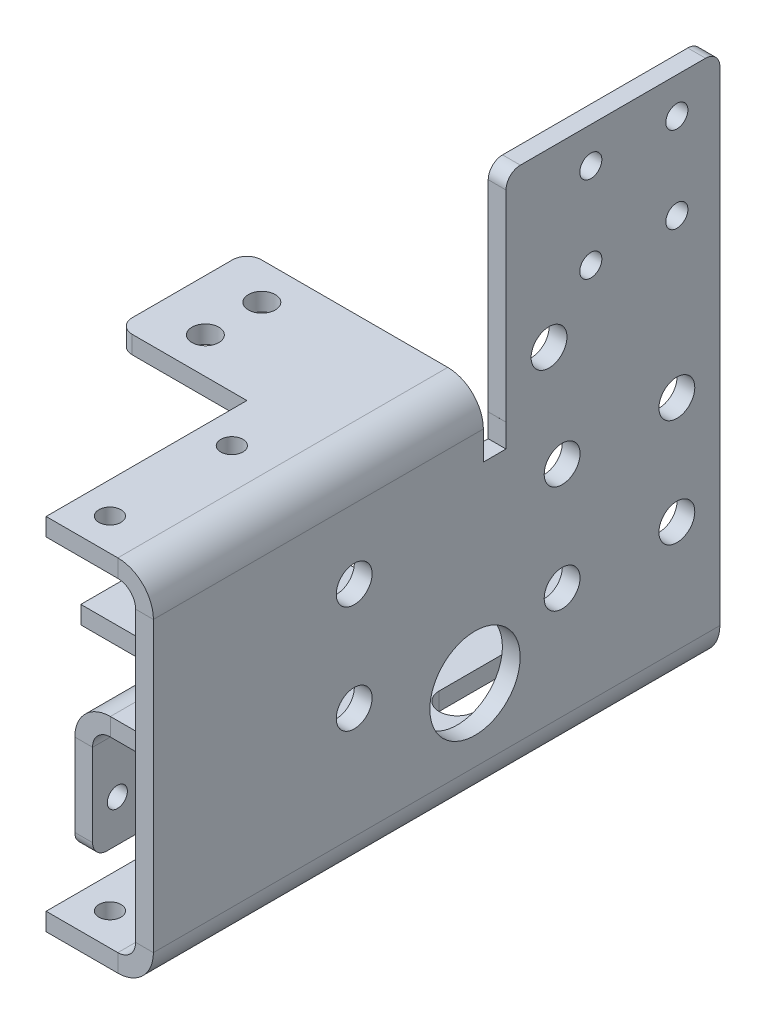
ISO-10303-21;
HEADER;
FILE_DESCRIPTION(('STEP AP214'),'2;1');
FILE_NAME('part.step','',(''),(''),'','','');
FILE_SCHEMA(('AUTOMOTIVE_DESIGN { 1 0 10303 214 1 1 1 1 }'));
ENDSEC;
DATA;
#1=APPLICATION_CONTEXT('core data for automotive mechanical design processes');
#2=APPLICATION_PROTOCOL_DEFINITION('international standard','automotive_design',2000,#1);
#3=PRODUCT_CONTEXT('',#1,'mechanical');
#4=PRODUCT('Part','Part','',(#3));
#5=PRODUCT_RELATED_PRODUCT_CATEGORY('part','',(#4));
#6=PRODUCT_DEFINITION_FORMATION('','',#4);
#7=PRODUCT_DEFINITION_CONTEXT('part definition',#1,'design');
#8=PRODUCT_DEFINITION('design','',#6,#7);
#9=PRODUCT_DEFINITION_SHAPE('','',#8);
#10=(LENGTH_UNIT() NAMED_UNIT(*) SI_UNIT(.MILLI.,.METRE.));
#11=(NAMED_UNIT(*) PLANE_ANGLE_UNIT() SI_UNIT($,.RADIAN.));
#12=(NAMED_UNIT(*) SI_UNIT($,.STERADIAN.) SOLID_ANGLE_UNIT());
#13=UNCERTAINTY_MEASURE_WITH_UNIT(LENGTH_MEASURE(1.E-05),#10,'distance_accuracy_value','');
#14=(GEOMETRIC_REPRESENTATION_CONTEXT(3) GLOBAL_UNCERTAINTY_ASSIGNED_CONTEXT((#13)) GLOBAL_UNIT_ASSIGNED_CONTEXT((#10,
#11,#12)) REPRESENTATION_CONTEXT('',''));
#15=CARTESIAN_POINT('',(0.,0.,0.));
#16=DIRECTION('',(0.,0.,1.));
#17=DIRECTION('',(1.,0.,0.));
#18=AXIS2_PLACEMENT_3D('',#15,#16,#17);
#19=CARTESIAN_POINT('',(28.4731693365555,0.,0.));
#20=DIRECTION('',(1.,0.,0.));
#21=DIRECTION('',(0.,1.,0.));
#22=AXIS2_PLACEMENT_3D('',#19,#20,#21);
#23=PLANE('',#22);
#24=CARTESIAN_POINT('',(28.4731693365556,11.43,11.4382628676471));
#25=DIRECTION('',(1.,0.,0.));
#26=DIRECTION('',(0.,1.,0.));
#27=AXIS2_PLACEMENT_3D('',#24,#25,#26);
#28=CIRCLE('',#27,1.5875);
#29=CARTESIAN_POINT('',(28.4731693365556,13.0175,11.4382628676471));
#30=VERTEX_POINT('',#29);
#31=EDGE_CURVE('E1550',#30,#30,#28,.T.);
#32=ORIENTED_EDGE('',*,*,#31,.F.);
#33=EDGE_LOOP('',(#32));
#34=FACE_BOUND('',#33,.T.);
#35=CARTESIAN_POINT('',(28.4731693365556,20.955,11.4382628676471));
#36=DIRECTION('',(1.,0.,0.));
#37=DIRECTION('',(0.,1.,0.));
#38=AXIS2_PLACEMENT_3D('',#35,#36,#37);
#39=CIRCLE('',#38,1.5875);
#40=CARTESIAN_POINT('',(28.4731693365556,22.5425,11.4382628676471));
#41=VERTEX_POINT('',#40);
#42=EDGE_CURVE('E1556',#41,#41,#39,.T.);
#43=ORIENTED_EDGE('',*,*,#42,.F.);
#44=EDGE_LOOP('',(#43));
#45=FACE_BOUND('',#44,.T.);
#46=CARTESIAN_POINT('',(28.4731693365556,11.43,-6.97673713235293));
#47=DIRECTION('',(1.,0.,0.));
#48=DIRECTION('',(0.,1.,0.));
#49=AXIS2_PLACEMENT_3D('',#46,#47,#48);
#50=CIRCLE('',#49,1.5875);
#51=CARTESIAN_POINT('',(28.4731693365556,13.0175,-6.97673713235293));
#52=VERTEX_POINT('',#51);
#53=EDGE_CURVE('E1562',#52,#52,#50,.T.);
#54=ORIENTED_EDGE('',*,*,#53,.F.);
#55=EDGE_LOOP('',(#54));
#56=FACE_BOUND('',#55,.T.);
#57=CARTESIAN_POINT('',(28.4731693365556,11.43,-17.1367371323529));
#58=DIRECTION('',(1.,0.,0.));
#59=DIRECTION('',(0.,1.,0.));
#60=AXIS2_PLACEMENT_3D('',#57,#58,#59);
#61=CIRCLE('',#60,1.5875);
#62=CARTESIAN_POINT('',(28.4731693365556,13.0175,-17.1367371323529));
#63=VERTEX_POINT('',#62);
#64=EDGE_CURVE('E1568',#63,#63,#61,.T.);
#65=ORIENTED_EDGE('',*,*,#64,.F.);
#66=EDGE_LOOP('',(#65));
#67=FACE_BOUND('',#66,.T.);
#68=CARTESIAN_POINT('',(28.4731693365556,20.955,-17.1367371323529));
#69=DIRECTION('',(1.,0.,0.));
#70=DIRECTION('',(0.,1.,0.));
#71=AXIS2_PLACEMENT_3D('',#68,#69,#70);
#72=CIRCLE('',#71,1.58750000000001);
#73=CARTESIAN_POINT('',(28.4731693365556,22.5425,-17.1367371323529));
#74=VERTEX_POINT('',#73);
#75=EDGE_CURVE('E1574',#74,#74,#72,.T.);
#76=ORIENTED_EDGE('',*,*,#75,.F.);
#77=EDGE_LOOP('',(#76));
#78=FACE_BOUND('',#77,.T.);
#79=CARTESIAN_POINT('',(28.4731693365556,20.955,-6.97673713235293));
#80=DIRECTION('',(1.,0.,0.));
#81=DIRECTION('',(0.,1.,0.));
#82=AXIS2_PLACEMENT_3D('',#79,#80,#81);
#83=CIRCLE('',#82,1.5875);
#84=CARTESIAN_POINT('',(28.4731693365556,22.5425,-6.97673713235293));
#85=VERTEX_POINT('',#84);
#86=EDGE_CURVE('E1580',#85,#85,#83,.T.);
#87=ORIENTED_EDGE('',*,*,#86,.F.);
#88=EDGE_LOOP('',(#87));
#89=FACE_BOUND('',#88,.T.);
#90=CARTESIAN_POINT('',(28.4731693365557,34.925,-17.1367371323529));
#91=DIRECTION('',(1.,0.,0.));
#92=DIRECTION('',(0.,1.,0.));
#93=AXIS2_PLACEMENT_3D('',#90,#91,#92);
#94=CIRCLE('',#93,0.9779);
#95=CARTESIAN_POINT('',(28.4731693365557,35.9029,-17.1367371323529));
#96=VERTEX_POINT('',#95);
#97=EDGE_CURVE('E1586',#96,#96,#94,.T.);
#98=ORIENTED_EDGE('',*,*,#97,.F.);
#99=EDGE_LOOP('',(#98));
#100=FACE_BOUND('',#99,.T.);
#101=CARTESIAN_POINT('',(28.4731693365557,34.925,-9.51673713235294));
#102=DIRECTION('',(1.,0.,0.));
#103=DIRECTION('',(0.,1.,0.));
#104=AXIS2_PLACEMENT_3D('',#101,#102,#103);
#105=CIRCLE('',#104,0.977900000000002);
#106=CARTESIAN_POINT('',(28.4731693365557,35.9029,-9.51673713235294));
#107=VERTEX_POINT('',#106);
#108=EDGE_CURVE('E1592',#107,#107,#105,.T.);
#109=ORIENTED_EDGE('',*,*,#108,.F.);
#110=EDGE_LOOP('',(#109));
#111=FACE_BOUND('',#110,.T.);
#112=CARTESIAN_POINT('',(28.4731693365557,42.545,-9.51673713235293));
#113=DIRECTION('',(1.,0.,0.));
#114=DIRECTION('',(0.,1.,0.));
#115=AXIS2_PLACEMENT_3D('',#112,#113,#114);
#116=CIRCLE('',#115,0.977900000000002);
#117=CARTESIAN_POINT('',(28.4731693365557,43.5229,-9.51673713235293));
#118=VERTEX_POINT('',#117);
#119=EDGE_CURVE('E1598',#118,#118,#116,.T.);
#120=ORIENTED_EDGE('',*,*,#119,.F.);
#121=EDGE_LOOP('',(#120));
#122=FACE_BOUND('',#121,.T.);
#123=CARTESIAN_POINT('',(28.4731693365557,42.545,-17.1367371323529));
#124=DIRECTION('',(1.,0.,0.));
#125=DIRECTION('',(0.,1.,0.));
#126=AXIS2_PLACEMENT_3D('',#123,#124,#125);
#127=CIRCLE('',#126,0.9779);
#128=CARTESIAN_POINT('',(28.4731693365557,43.5229,-17.1367371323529));
#129=VERTEX_POINT('',#128);
#130=EDGE_CURVE('E1604',#129,#129,#127,.T.);
#131=ORIENTED_EDGE('',*,*,#130,.F.);
#132=EDGE_LOOP('',(#131));
#133=FACE_BOUND('',#132,.T.);
#134=CARTESIAN_POINT('',(28.4731693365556,30.48,-5.8173331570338));
#135=DIRECTION('',(1.,0.,0.));
#136=DIRECTION('',(0.,1.,0.));
#137=AXIS2_PLACEMENT_3D('',#134,#135,#136);
#138=CIRCLE('',#137,1.5875);
#139=CARTESIAN_POINT('',(28.4731693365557,32.0675,-5.8173331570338));
#140=VERTEX_POINT('',#139);
#141=EDGE_CURVE('E1610',#140,#140,#138,.T.);
#142=ORIENTED_EDGE('',*,*,#141,.F.);
#143=EDGE_LOOP('',(#142));
#144=FACE_BOUND('',#143,.T.);
#145=CARTESIAN_POINT('',(28.4731693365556,7.99999999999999,0.738262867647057));
#146=DIRECTION('',(1.,0.,0.));
#147=DIRECTION('',(0.,1.,0.));
#148=AXIS2_PLACEMENT_3D('',#145,#146,#147);
#149=CIRCLE('',#148,4.);
#150=CARTESIAN_POINT('',(28.4731693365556,12.,0.738262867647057));
#151=VERTEX_POINT('',#150);
#152=EDGE_CURVE('E656',#151,#151,#149,.T.);
#153=ORIENTED_EDGE('',*,*,#152,.F.);
#154=EDGE_LOOP('',(#153));
#155=FACE_BOUND('',#154,.T.);
#156=DIRECTION('',(0.,0.,-1.));
#157=VECTOR('',#156,1.);
#158=CARTESIAN_POINT('',(28.4731693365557,45.72,0.));
#159=LINE('',#158,#157);
#160=CARTESIAN_POINT('',(28.4731693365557,45.72,-19.6767371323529));
#161=VERTEX_POINT('',#160);
#162=CARTESIAN_POINT('',(28.4731693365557,45.72,-3.2773331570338));
#163=VERTEX_POINT('',#162);
#164=EDGE_CURVE('E640',#161,#163,#159,.F.);
#165=ORIENTED_EDGE('',*,*,#164,.T.);
#166=CARTESIAN_POINT('',(28.4731693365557,44.45,-3.2773331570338));
#167=DIRECTION('',(1.,0.,0.));
#168=DIRECTION('',(0.,1.,0.));
#169=AXIS2_PLACEMENT_3D('',#166,#167,#168);
#170=CIRCLE('',#169,1.27);
#171=CARTESIAN_POINT('',(28.4731693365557,44.45,-2.0073331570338));
#172=VERTEX_POINT('',#171);
#173=EDGE_CURVE('E129',#163,#172,#170,.T.);
#174=ORIENTED_EDGE('',*,*,#173,.T.);
#175=DIRECTION('',(0.,1.,0.));
#176=VECTOR('',#175,1.);
#177=CARTESIAN_POINT('',(28.4731693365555,0.,-2.0073331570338));
#178=LINE('',#177,#176);
#179=CARTESIAN_POINT('',(28.4731693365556,26.6446,-2.0073331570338));
#180=VERTEX_POINT('',#179);
#181=EDGE_CURVE('E638',#172,#180,#178,.F.);
#182=ORIENTED_EDGE('',*,*,#181,.T.);
#183=DIRECTION('',(0.,0.,-1.));
#184=VECTOR('',#183,1.);
#185=CARTESIAN_POINT('',(28.4731693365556,26.6446,0.));
#186=LINE('',#185,#184);
#187=CARTESIAN_POINT('',(28.4731693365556,26.6446,-2.0066));
#188=VERTEX_POINT('',#187);
#189=EDGE_CURVE('E635',#180,#188,#186,.F.);
#190=ORIENTED_EDGE('',*,*,#189,.T.);
#191=DIRECTION('',(0.,-1.,0.));
#192=VECTOR('',#191,1.);
#193=CARTESIAN_POINT('',(28.4731693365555,0.,-2.0066));
#194=LINE('',#193,#192);
#195=CARTESIAN_POINT('',(28.4731693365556,24.5852,-2.0066));
#196=VERTEX_POINT('',#195);
#197=EDGE_CURVE('E508',#188,#196,#194,.T.);
#198=ORIENTED_EDGE('',*,*,#197,.T.);
#199=DIRECTION('',(0.,0.,1.));
#200=VECTOR('',#199,1.);
#201=CARTESIAN_POINT('',(28.4731693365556,24.5852,0.));
#202=LINE('',#201,#200);
#203=CARTESIAN_POINT('',(28.4731693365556,24.5852,0.));
#204=VERTEX_POINT('',#203);
#205=EDGE_CURVE('E524',#196,#204,#202,.T.);
#206=ORIENTED_EDGE('',*,*,#205,.T.);
#207=DIRECTION('',(0.,1.,0.));
#208=VECTOR('',#207,1.);
#209=CARTESIAN_POINT('',(28.4731693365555,0.,0.));
#210=LINE('',#209,#208);
#211=CARTESIAN_POINT('',(28.4731693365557,27.1252,0.));
#212=VERTEX_POINT('',#211);
#213=EDGE_CURVE('E521',#204,#212,#210,.T.);
#214=ORIENTED_EDGE('',*,*,#213,.T.);
#215=DIRECTION('',(0.,0.,-1.));
#216=VECTOR('',#215,1.);
#217=CARTESIAN_POINT('',(28.4731693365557,27.1252,0.));
#218=LINE('',#217,#216);
#219=CARTESIAN_POINT('',(28.4731693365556,27.1252,29.2182628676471));
#220=VERTEX_POINT('',#219);
#221=EDGE_CURVE('E482',#212,#220,#218,.F.);
#222=ORIENTED_EDGE('',*,*,#221,.T.);
#223=DIRECTION('',(0.,1.,0.));
#224=VECTOR('',#223,1.);
#225=CARTESIAN_POINT('',(28.4731693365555,0.,29.2182628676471));
#226=LINE('',#225,#224);
#227=CARTESIAN_POINT('',(28.4731693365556,1.57479999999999,29.2182628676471));
#228=VERTEX_POINT('',#227);
#229=EDGE_CURVE('E644',#220,#228,#226,.F.);
#230=ORIENTED_EDGE('',*,*,#229,.T.);
#231=DIRECTION('',(0.,0.,-1.));
#232=VECTOR('',#231,1.);
#233=CARTESIAN_POINT('',(28.4731693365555,1.57479999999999,0.));
#234=LINE('',#233,#232);
#235=CARTESIAN_POINT('',(28.4731693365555,1.57479999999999,-20.9467371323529));
#236=VERTEX_POINT('',#235);
#237=EDGE_CURVE('E662',#228,#236,#234,.T.);
#238=ORIENTED_EDGE('',*,*,#237,.T.);
#239=DIRECTION('',(0.,-1.,0.));
#240=VECTOR('',#239,1.);
#241=CARTESIAN_POINT('',(28.4731693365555,0.,-20.9467371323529));
#242=LINE('',#241,#240);
#243=CARTESIAN_POINT('',(28.4731693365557,44.45,-20.9467371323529));
#244=VERTEX_POINT('',#243);
#245=EDGE_CURVE('E642',#236,#244,#242,.F.);
#246=ORIENTED_EDGE('',*,*,#245,.T.);
#247=CARTESIAN_POINT('',(28.4731693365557,44.45,-19.6767371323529));
#248=DIRECTION('',(1.,0.,0.));
#249=DIRECTION('',(0.,1.,0.));
#250=AXIS2_PLACEMENT_3D('',#247,#248,#249);
#251=CIRCLE('',#250,1.27);
#252=EDGE_CURVE('E870',#244,#161,#251,.T.);
#253=ORIENTED_EDGE('',*,*,#252,.T.);
#254=EDGE_LOOP('',(#165,#174,#182,#190,#198,#206,#214,#222,#230,#238,#246,#253));
#255=FACE_BOUND('',#254,.T.);
#256=ADVANCED_FACE('F120',(#34,#45,#56,#67,#78,#89,#100,#111,#122,#133,#144,#155,#255),#23,.T.);
#257=CARTESIAN_POINT('',(26.8983693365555,0.,0.));
#258=DIRECTION('',(1.,0.,0.));
#259=DIRECTION('',(0.,1.,0.));
#260=AXIS2_PLACEMENT_3D('',#257,#258,#259);
#261=PLANE('',#260);
#262=CARTESIAN_POINT('',(26.8983693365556,11.43,11.4382628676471));
#263=DIRECTION('',(1.,0.,0.));
#264=DIRECTION('',(0.,1.,0.));
#265=AXIS2_PLACEMENT_3D('',#262,#263,#264);
#266=CIRCLE('',#265,1.5875);
#267=CARTESIAN_POINT('',(26.8983693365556,13.0175,11.4382628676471));
#268=VERTEX_POINT('',#267);
#269=EDGE_CURVE('E1553',#268,#268,#266,.F.);
#270=ORIENTED_EDGE('',*,*,#269,.F.);
#271=EDGE_LOOP('',(#270));
#272=FACE_BOUND('',#271,.T.);
#273=CARTESIAN_POINT('',(26.8983693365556,20.955,11.4382628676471));
#274=DIRECTION('',(1.,0.,0.));
#275=DIRECTION('',(0.,1.,0.));
#276=AXIS2_PLACEMENT_3D('',#273,#274,#275);
#277=CIRCLE('',#276,1.5875);
#278=CARTESIAN_POINT('',(26.8983693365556,22.5425,11.4382628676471));
#279=VERTEX_POINT('',#278);
#280=EDGE_CURVE('E1559',#279,#279,#277,.F.);
#281=ORIENTED_EDGE('',*,*,#280,.F.);
#282=EDGE_LOOP('',(#281));
#283=FACE_BOUND('',#282,.T.);
#284=CARTESIAN_POINT('',(26.8983693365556,11.43,-6.97673713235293));
#285=DIRECTION('',(1.,0.,0.));
#286=DIRECTION('',(0.,1.,0.));
#287=AXIS2_PLACEMENT_3D('',#284,#285,#286);
#288=CIRCLE('',#287,1.5875);
#289=CARTESIAN_POINT('',(26.8983693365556,13.0175,-6.97673713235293));
#290=VERTEX_POINT('',#289);
#291=EDGE_CURVE('E1565',#290,#290,#288,.F.);
#292=ORIENTED_EDGE('',*,*,#291,.F.);
#293=EDGE_LOOP('',(#292));
#294=FACE_BOUND('',#293,.T.);
#295=CARTESIAN_POINT('',(26.8983693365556,11.43,-17.1367371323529));
#296=DIRECTION('',(1.,0.,0.));
#297=DIRECTION('',(0.,1.,0.));
#298=AXIS2_PLACEMENT_3D('',#295,#296,#297);
#299=CIRCLE('',#298,1.5875);
#300=CARTESIAN_POINT('',(26.8983693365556,13.0175,-17.1367371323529));
#301=VERTEX_POINT('',#300);
#302=EDGE_CURVE('E1571',#301,#301,#299,.F.);
#303=ORIENTED_EDGE('',*,*,#302,.F.);
#304=EDGE_LOOP('',(#303));
#305=FACE_BOUND('',#304,.T.);
#306=CARTESIAN_POINT('',(26.8983693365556,20.955,-17.1367371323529));
#307=DIRECTION('',(1.,0.,0.));
#308=DIRECTION('',(0.,1.,0.));
#309=AXIS2_PLACEMENT_3D('',#306,#307,#308);
#310=CIRCLE('',#309,1.58750000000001);
#311=CARTESIAN_POINT('',(26.8983693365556,22.5425,-17.1367371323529));
#312=VERTEX_POINT('',#311);
#313=EDGE_CURVE('E1577',#312,#312,#310,.F.);
#314=ORIENTED_EDGE('',*,*,#313,.F.);
#315=EDGE_LOOP('',(#314));
#316=FACE_BOUND('',#315,.T.);
#317=CARTESIAN_POINT('',(26.8983693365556,20.955,-6.97673713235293));
#318=DIRECTION('',(1.,0.,0.));
#319=DIRECTION('',(0.,1.,0.));
#320=AXIS2_PLACEMENT_3D('',#317,#318,#319);
#321=CIRCLE('',#320,1.5875);
#322=CARTESIAN_POINT('',(26.8983693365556,22.5425,-6.97673713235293));
#323=VERTEX_POINT('',#322);
#324=EDGE_CURVE('E1583',#323,#323,#321,.F.);
#325=ORIENTED_EDGE('',*,*,#324,.F.);
#326=EDGE_LOOP('',(#325));
#327=FACE_BOUND('',#326,.T.);
#328=CARTESIAN_POINT('',(26.8983693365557,34.925,-17.1367371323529));
#329=DIRECTION('',(1.,0.,0.));
#330=DIRECTION('',(0.,1.,0.));
#331=AXIS2_PLACEMENT_3D('',#328,#329,#330);
#332=CIRCLE('',#331,0.9779);
#333=CARTESIAN_POINT('',(26.8983693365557,35.9029,-17.1367371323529));
#334=VERTEX_POINT('',#333);
#335=EDGE_CURVE('E1589',#334,#334,#332,.F.);
#336=ORIENTED_EDGE('',*,*,#335,.F.);
#337=EDGE_LOOP('',(#336));
#338=FACE_BOUND('',#337,.T.);
#339=CARTESIAN_POINT('',(26.8983693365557,34.925,-9.51673713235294));
#340=DIRECTION('',(1.,0.,0.));
#341=DIRECTION('',(0.,1.,0.));
#342=AXIS2_PLACEMENT_3D('',#339,#340,#341);
#343=CIRCLE('',#342,0.977900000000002);
#344=CARTESIAN_POINT('',(26.8983693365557,35.9029,-9.51673713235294));
#345=VERTEX_POINT('',#344);
#346=EDGE_CURVE('E1595',#345,#345,#343,.F.);
#347=ORIENTED_EDGE('',*,*,#346,.F.);
#348=EDGE_LOOP('',(#347));
#349=FACE_BOUND('',#348,.T.);
#350=CARTESIAN_POINT('',(26.8983693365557,42.545,-9.51673713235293));
#351=DIRECTION('',(1.,0.,0.));
#352=DIRECTION('',(0.,1.,0.));
#353=AXIS2_PLACEMENT_3D('',#350,#351,#352);
#354=CIRCLE('',#353,0.977900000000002);
#355=CARTESIAN_POINT('',(26.8983693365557,43.5229,-9.51673713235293));
#356=VERTEX_POINT('',#355);
#357=EDGE_CURVE('E1601',#356,#356,#354,.F.);
#358=ORIENTED_EDGE('',*,*,#357,.F.);
#359=EDGE_LOOP('',(#358));
#360=FACE_BOUND('',#359,.T.);
#361=CARTESIAN_POINT('',(26.8983693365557,42.545,-17.1367371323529));
#362=DIRECTION('',(1.,0.,0.));
#363=DIRECTION('',(0.,1.,0.));
#364=AXIS2_PLACEMENT_3D('',#361,#362,#363);
#365=CIRCLE('',#364,0.9779);
#366=CARTESIAN_POINT('',(26.8983693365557,43.5229,-17.1367371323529));
#367=VERTEX_POINT('',#366);
#368=EDGE_CURVE('E1607',#367,#367,#365,.F.);
#369=ORIENTED_EDGE('',*,*,#368,.F.);
#370=EDGE_LOOP('',(#369));
#371=FACE_BOUND('',#370,.T.);
#372=CARTESIAN_POINT('',(26.8983693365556,30.48,-5.8173331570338));
#373=DIRECTION('',(1.,0.,0.));
#374=DIRECTION('',(0.,1.,0.));
#375=AXIS2_PLACEMENT_3D('',#372,#373,#374);
#376=CIRCLE('',#375,1.5875);
#377=CARTESIAN_POINT('',(26.8983693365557,32.0675,-5.8173331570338));
#378=VERTEX_POINT('',#377);
#379=EDGE_CURVE('E1612',#378,#378,#376,.F.);
#380=ORIENTED_EDGE('',*,*,#379,.F.);
#381=EDGE_LOOP('',(#380));
#382=FACE_BOUND('',#381,.T.);
#383=CARTESIAN_POINT('',(26.8983693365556,8.,0.738262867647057));
#384=DIRECTION('',(1.,0.,0.));
#385=DIRECTION('',(0.,1.,0.));
#386=AXIS2_PLACEMENT_3D('',#383,#384,#385);
#387=CIRCLE('',#386,4.);
#388=CARTESIAN_POINT('',(26.8983693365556,12.,0.738262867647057));
#389=VERTEX_POINT('',#388);
#390=EDGE_CURVE('E659',#389,#389,#387,.T.);
#391=ORIENTED_EDGE('',*,*,#390,.T.);
#392=EDGE_LOOP('',(#391));
#393=FACE_BOUND('',#392,.T.);
#394=DIRECTION('',(0.,-1.,0.));
#395=VECTOR('',#394,1.);
#396=CARTESIAN_POINT('',(26.8983693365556,26.6446,-2.0073331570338));
#397=LINE('',#396,#395);
#398=CARTESIAN_POINT('',(26.8983693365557,44.45,-2.0073331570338));
#399=VERTEX_POINT('',#398);
#400=CARTESIAN_POINT('',(26.8983693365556,26.6446,-2.0073331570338));
#401=VERTEX_POINT('',#400);
#402=EDGE_CURVE('E648',#399,#401,#397,.T.);
#403=ORIENTED_EDGE('',*,*,#402,.F.);
#404=CARTESIAN_POINT('',(26.8983693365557,44.45,-3.2773331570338));
#405=DIRECTION('',(1.,0.,0.));
#406=DIRECTION('',(0.,1.,0.));
#407=AXIS2_PLACEMENT_3D('',#404,#405,#406);
#408=CIRCLE('',#407,1.27);
#409=CARTESIAN_POINT('',(26.8983693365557,45.72,-3.2773331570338));
#410=VERTEX_POINT('',#409);
#411=EDGE_CURVE('E864',#399,#410,#408,.F.);
#412=ORIENTED_EDGE('',*,*,#411,.T.);
#413=DIRECTION('',(0.,0.,1.));
#414=VECTOR('',#413,1.);
#415=CARTESIAN_POINT('',(26.8983693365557,45.72,-2.0073331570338));
#416=LINE('',#415,#414);
#417=CARTESIAN_POINT('',(26.8983693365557,45.72,-19.6767371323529));
#418=VERTEX_POINT('',#417);
#419=EDGE_CURVE('E650',#418,#410,#416,.T.);
#420=ORIENTED_EDGE('',*,*,#419,.F.);
#421=CARTESIAN_POINT('',(26.8983693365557,44.45,-19.6767371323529));
#422=DIRECTION('',(1.,0.,0.));
#423=DIRECTION('',(0.,1.,0.));
#424=AXIS2_PLACEMENT_3D('',#421,#422,#423);
#425=CIRCLE('',#424,1.27);
#426=CARTESIAN_POINT('',(26.8983693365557,44.45,-20.9467371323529));
#427=VERTEX_POINT('',#426);
#428=EDGE_CURVE('E862',#418,#427,#425,.F.);
#429=ORIENTED_EDGE('',*,*,#428,.T.);
#430=DIRECTION('',(0.,1.,0.));
#431=VECTOR('',#430,1.);
#432=CARTESIAN_POINT('',(26.8983693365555,0.,-20.9467371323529));
#433=LINE('',#432,#431);
#434=CARTESIAN_POINT('',(26.8983693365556,1.57479999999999,-20.9467371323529));
#435=VERTEX_POINT('',#434);
#436=EDGE_CURVE('E652',#435,#427,#433,.T.);
#437=ORIENTED_EDGE('',*,*,#436,.F.);
#438=DIRECTION('',(0.,0.,1.));
#439=VECTOR('',#438,1.);
#440=CARTESIAN_POINT('',(26.8983693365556,1.57479999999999,29.2182628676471));
#441=LINE('',#440,#439);
#442=CARTESIAN_POINT('',(26.8983693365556,1.57479999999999,29.2182628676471));
#443=VERTEX_POINT('',#442);
#444=EDGE_CURVE('E668',#443,#435,#441,.F.);
#445=ORIENTED_EDGE('',*,*,#444,.F.);
#446=DIRECTION('',(0.,-1.,0.));
#447=VECTOR('',#446,1.);
#448=CARTESIAN_POINT('',(26.8983693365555,0.,29.2182628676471));
#449=LINE('',#448,#447);
#450=CARTESIAN_POINT('',(26.8983693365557,27.1252,29.2182628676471));
#451=VERTEX_POINT('',#450);
#452=EDGE_CURVE('E654',#451,#443,#449,.T.);
#453=ORIENTED_EDGE('',*,*,#452,.F.);
#454=DIRECTION('',(0.,0.,-1.));
#455=VECTOR('',#454,1.);
#456=CARTESIAN_POINT('',(26.8983693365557,27.1252,0.));
#457=LINE('',#456,#455);
#458=CARTESIAN_POINT('',(26.8983693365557,27.1252,0.));
#459=VERTEX_POINT('',#458);
#460=EDGE_CURVE('E495',#459,#451,#457,.F.);
#461=ORIENTED_EDGE('',*,*,#460,.F.);
#462=DIRECTION('',(0.,1.,0.));
#463=VECTOR('',#462,1.);
#464=CARTESIAN_POINT('',(26.8983693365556,24.5852,0.));
#465=LINE('',#464,#463);
#466=CARTESIAN_POINT('',(26.8983693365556,24.5852,0.));
#467=VERTEX_POINT('',#466);
#468=EDGE_CURVE('E513',#467,#459,#465,.T.);
#469=ORIENTED_EDGE('',*,*,#468,.F.);
#470=DIRECTION('',(0.,0.,1.));
#471=VECTOR('',#470,1.);
#472=CARTESIAN_POINT('',(26.8983693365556,24.5852,-2.0066));
#473=LINE('',#472,#471);
#474=CARTESIAN_POINT('',(26.8983693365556,24.5852,-2.0066));
#475=VERTEX_POINT('',#474);
#476=EDGE_CURVE('E509',#475,#467,#473,.T.);
#477=ORIENTED_EDGE('',*,*,#476,.F.);
#478=DIRECTION('',(0.,-1.,0.));
#479=VECTOR('',#478,1.);
#480=CARTESIAN_POINT('',(26.8983693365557,28.7,-2.0066));
#481=LINE('',#480,#479);
#482=CARTESIAN_POINT('',(26.8983693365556,26.6446,-2.0066));
#483=VERTEX_POINT('',#482);
#484=EDGE_CURVE('E505',#483,#475,#481,.T.);
#485=ORIENTED_EDGE('',*,*,#484,.F.);
#486=DIRECTION('',(0.,0.,1.));
#487=VECTOR('',#486,1.);
#488=CARTESIAN_POINT('',(26.8983693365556,26.6446,-0.000733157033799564));
#489=LINE('',#488,#487);
#490=EDGE_CURVE('E646',#401,#483,#489,.T.);
#491=ORIENTED_EDGE('',*,*,#490,.F.);
#492=EDGE_LOOP('',(#403,#412,#420,#429,#437,#445,#453,#461,#469,#477,#485,#491));
#493=FACE_BOUND('',#492,.T.);
#494=ADVANCED_FACE('F958',(#272,#283,#294,#305,#316,#327,#338,#349,#360,#371,#382,#393,#493),
#261,.F.);
#495=CARTESIAN_POINT('',(28.4731693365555,0.,29.2182628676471));
#496=DIRECTION('',(0.,0.,-1.));
#497=DIRECTION('',(-1.,0.,0.));
#498=AXIS2_PLACEMENT_3D('',#495,#496,#497);
#499=PLANE('',#498);
#500=DIRECTION('',(1.,0.,0.));
#501=VECTOR('',#500,1.);
#502=CARTESIAN_POINT('',(26.8983693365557,27.1252,29.2182628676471));
#503=LINE('',#502,#501);
#504=EDGE_CURVE('E499',#451,#220,#503,.T.);
#505=ORIENTED_EDGE('',*,*,#504,.F.);
#506=ORIENTED_EDGE('',*,*,#452,.T.);
#507=DIRECTION('',(-1.,0.,0.));
#508=VECTOR('',#507,1.);
#509=CARTESIAN_POINT('',(28.4731693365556,1.57479999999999,29.2182628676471));
#510=LINE('',#509,#508);
#511=EDGE_CURVE('E629',#443,#228,#510,.F.);
#512=ORIENTED_EDGE('',*,*,#511,.T.);
#513=ORIENTED_EDGE('',*,*,#229,.F.);
#514=EDGE_LOOP('',(#505,#506,#512,#513));
#515=FACE_BOUND('',#514,.T.);
#516=ADVANCED_FACE('F967',(#515),#499,.F.);
#517=CARTESIAN_POINT('',(28.4731693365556,26.6446,-0.000733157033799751));
#518=DIRECTION('',(0.,-1.,0.));
#519=DIRECTION('',(1.,0.,0.));
#520=AXIS2_PLACEMENT_3D('',#517,#518,#519);
#521=PLANE('',#520);
#522=DIRECTION('',(-1.,0.,0.));
#523=VECTOR('',#522,1.);
#524=CARTESIAN_POINT('',(28.4731693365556,26.6446,-2.0066));
#525=LINE('',#524,#523);
#526=EDGE_CURVE('E794',#188,#483,#525,.T.);
#527=ORIENTED_EDGE('',*,*,#526,.F.);
#528=ORIENTED_EDGE('',*,*,#189,.F.);
#529=DIRECTION('',(1.,0.,0.));
#530=VECTOR('',#529,1.);
#531=CARTESIAN_POINT('',(28.4731693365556,26.6446,-2.0073331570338));
#532=LINE('',#531,#530);
#533=EDGE_CURVE('E631',#180,#401,#532,.F.);
#534=ORIENTED_EDGE('',*,*,#533,.T.);
#535=ORIENTED_EDGE('',*,*,#490,.T.);
#536=EDGE_LOOP('',(#527,#528,#534,#535));
#537=FACE_BOUND('',#536,.T.);
#538=ADVANCED_FACE('F1011',(#537),#521,.F.);
#539=CARTESIAN_POINT('',(0.,-1.5748,0.));
#540=DIRECTION('',(0.,-1.,0.));
#541=DIRECTION('',(0.,0.,-1.));
#542=AXIS2_PLACEMENT_3D('',#539,#540,#541);
#543=PLANE('',#542);
#544=CARTESIAN_POINT('',(2.09856933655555,-1.5748,-6.97673713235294));
#545=DIRECTION('',(0.,-1.,0.));
#546=DIRECTION('',(0.,0.,-1.));
#547=AXIS2_PLACEMENT_3D('',#544,#545,#546);
#548=CIRCLE('',#547,2.6123011);
#549=CARTESIAN_POINT('',(2.09856933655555,-1.5748,-9.58903823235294));
#550=VERTEX_POINT('',#549);
#551=EDGE_CURVE('E1537',#550,#550,#548,.T.);
#552=ORIENTED_EDGE('',*,*,#551,.F.);
#553=EDGE_LOOP('',(#552));
#554=FACE_BOUND('',#553,.T.);
#555=CARTESIAN_POINT('',(12.0985693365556,-1.5748,-6.97673713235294));
#556=DIRECTION('',(0.,-1.,0.));
#557=DIRECTION('',(0.,0.,-1.));
#558=AXIS2_PLACEMENT_3D('',#555,#556,#557);
#559=CIRCLE('',#558,2.6123011);
#560=CARTESIAN_POINT('',(12.0985693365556,-1.5748,-9.58903823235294));
#561=VERTEX_POINT('',#560);
#562=EDGE_CURVE('E1541',#561,#561,#559,.T.);
#563=ORIENTED_EDGE('',*,*,#562,.F.);
#564=EDGE_LOOP('',(#563));
#565=FACE_BOUND('',#564,.T.);
#566=CARTESIAN_POINT('',(21.7675693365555,-1.5748,15.5657628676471));
#567=DIRECTION('',(0.,1.,0.));
#568=DIRECTION('',(0.,0.,1.));
#569=AXIS2_PLACEMENT_3D('',#566,#567,#568);
#570=CIRCLE('',#569,0.977899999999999);
#571=CARTESIAN_POINT('',(21.7675693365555,-1.5748,16.5436628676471));
#572=VERTEX_POINT('',#571);
#573=EDGE_CURVE('E684',#572,#572,#570,.T.);
#574=ORIENTED_EDGE('',*,*,#573,.T.);
#575=EDGE_LOOP('',(#574));
#576=FACE_BOUND('',#575,.T.);
#577=CARTESIAN_POINT('',(21.7675693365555,-1.5748,26.3607628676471));
#578=DIRECTION('',(0.,1.,0.));
#579=DIRECTION('',(0.,0.,1.));
#580=AXIS2_PLACEMENT_3D('',#577,#578,#579);
#581=CIRCLE('',#580,0.977899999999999);
#582=CARTESIAN_POINT('',(21.7675693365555,-1.5748,27.3386628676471));
#583=VERTEX_POINT('',#582);
#584=EDGE_CURVE('E690',#583,#583,#581,.T.);
#585=ORIENTED_EDGE('',*,*,#584,.T.);
#586=EDGE_LOOP('',(#585));
#587=FACE_BOUND('',#586,.T.);
#588=CARTESIAN_POINT('',(21.0690693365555,-1.5748,-12.0694371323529));
#589=DIRECTION('',(0.,1.,0.));
#590=DIRECTION('',(0.,0.,1.));
#591=AXIS2_PLACEMENT_3D('',#588,#589,#590);
#592=CIRCLE('',#591,1.5875);
#593=CARTESIAN_POINT('',(22.6565693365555,-1.5748,-12.0694371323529));
#594=VERTEX_POINT('',#593);
#595=CARTESIAN_POINT('',(19.4815693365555,-1.5748,-12.0694371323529));
#596=VERTEX_POINT('',#595);
#597=EDGE_CURVE('E696',#594,#596,#592,.T.);
#598=ORIENTED_EDGE('',*,*,#597,.T.);
#599=DIRECTION('',(0.,0.,1.));
#600=VECTOR('',#599,1.);
#601=CARTESIAN_POINT('',(19.4815693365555,-1.5748,-12.0694371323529));
#602=LINE('',#601,#600);
#603=CARTESIAN_POINT('',(19.4815693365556,-1.5748,-5.08443713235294));
#604=VERTEX_POINT('',#603);
#605=EDGE_CURVE('E699',#596,#604,#602,.T.);
#606=ORIENTED_EDGE('',*,*,#605,.T.);
#607=CARTESIAN_POINT('',(21.0690693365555,-1.5748,-5.08443713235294));
#608=DIRECTION('',(0.,1.,0.));
#609=DIRECTION('',(0.,0.,1.));
#610=AXIS2_PLACEMENT_3D('',#607,#608,#609);
#611=CIRCLE('',#610,1.5875);
#612=CARTESIAN_POINT('',(22.6565693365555,-1.5748,-5.08443713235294));
#613=VERTEX_POINT('',#612);
#614=EDGE_CURVE('E703',#604,#613,#611,.T.);
#615=ORIENTED_EDGE('',*,*,#614,.T.);
#616=DIRECTION('',(0.,0.,-1.));
#617=VECTOR('',#616,1.);
#618=CARTESIAN_POINT('',(22.6565693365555,-1.5748,-12.0694371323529));
#619=LINE('',#618,#617);
#620=EDGE_CURVE('E706',#613,#594,#619,.T.);
#621=ORIENTED_EDGE('',*,*,#620,.T.);
#622=EDGE_LOOP('',(#598,#606,#615,#621));
#623=FACE_BOUND('',#622,.T.);
#624=DIRECTION('',(0.,0.,1.));
#625=VECTOR('',#624,1.);
#626=CARTESIAN_POINT('',(-3.02283066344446,-1.5748,4.14846286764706));
#627=LINE('',#626,#625);
#628=CARTESIAN_POINT('',(-3.02283066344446,-1.5748,-9.51673713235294));
#629=VERTEX_POINT('',#628);
#630=CARTESIAN_POINT('',(-3.02283066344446,-1.5748,4.14846286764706));
#631=VERTEX_POINT('',#630);
#632=EDGE_CURVE('E743',#629,#631,#627,.T.);
#633=ORIENTED_EDGE('',*,*,#632,.F.);
#634=CARTESIAN_POINT('',(-1.75283066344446,-1.5748,-9.51673713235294));
#635=DIRECTION('',(0.,-1.,0.));
#636=DIRECTION('',(0.,0.,-1.));
#637=AXIS2_PLACEMENT_3D('',#634,#635,#636);
#638=CIRCLE('',#637,1.27);
#639=CARTESIAN_POINT('',(-1.75283066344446,-1.5748,-10.7867371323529));
#640=VERTEX_POINT('',#639);
#641=EDGE_CURVE('E823',#629,#640,#638,.T.);
#642=ORIENTED_EDGE('',*,*,#641,.T.);
#643=DIRECTION('',(-1.,0.,0.));
#644=VECTOR('',#643,1.);
#645=CARTESIAN_POINT('',(-3.02283066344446,-1.5748,-10.7867371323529));
#646=LINE('',#645,#644);
#647=CARTESIAN_POINT('',(10.0835693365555,-1.5748,-10.7867371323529));
#648=VERTEX_POINT('',#647);
#649=EDGE_CURVE('E740',#648,#640,#646,.T.);
#650=ORIENTED_EDGE('',*,*,#649,.F.);
#651=DIRECTION('',(0.,0.,1.));
#652=VECTOR('',#651,1.);
#653=CARTESIAN_POINT('',(10.0835693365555,-1.5748,-10.7867371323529));
#654=LINE('',#653,#652);
#655=CARTESIAN_POINT('',(10.0835693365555,-1.5748,-16.1969371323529));
#656=VERTEX_POINT('',#655);
#657=EDGE_CURVE('E737',#656,#648,#654,.T.);
#658=ORIENTED_EDGE('',*,*,#657,.F.);
#659=DIRECTION('',(1.,0.,0.));
#660=VECTOR('',#659,1.);
#661=CARTESIAN_POINT('',(10.0835693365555,-1.5748,-16.1969371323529));
#662=LINE('',#661,#660);
#663=CARTESIAN_POINT('',(6.88316933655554,-1.5748,-16.1969371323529));
#664=VERTEX_POINT('',#663);
#665=EDGE_CURVE('E735',#664,#656,#662,.T.);
#666=ORIENTED_EDGE('',*,*,#665,.F.);
#667=DIRECTION('',(0.,0.,-1.));
#668=VECTOR('',#667,1.);
#669=CARTESIAN_POINT('',(6.88316933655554,-1.5748,-20.9467371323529));
#670=LINE('',#669,#668);
#671=CARTESIAN_POINT('',(6.88316933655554,-1.5748,-20.9467371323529));
#672=VERTEX_POINT('',#671);
#673=EDGE_CURVE('E621',#672,#664,#670,.F.);
#674=ORIENTED_EDGE('',*,*,#673,.F.);
#675=DIRECTION('',(-1.,0.,0.));
#676=VECTOR('',#675,1.);
#677=CARTESIAN_POINT('',(3.73356933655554,-1.5748,-20.9467371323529));
#678=LINE('',#677,#676);
#679=CARTESIAN_POINT('',(25.3235693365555,-1.5748,-20.9467371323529));
#680=VERTEX_POINT('',#679);
#681=EDGE_CURVE('E731',#680,#672,#678,.T.);
#682=ORIENTED_EDGE('',*,*,#681,.F.);
#683=DIRECTION('',(0.,0.,-1.));
#684=VECTOR('',#683,1.);
#685=CARTESIAN_POINT('',(25.3235693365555,-1.5748,11.4382628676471));
#686=LINE('',#685,#684);
#687=CARTESIAN_POINT('',(25.3235693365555,-1.5748,29.2182628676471));
#688=VERTEX_POINT('',#687);
#689=EDGE_CURVE('E728',#688,#680,#686,.T.);
#690=ORIENTED_EDGE('',*,*,#689,.F.);
#691=DIRECTION('',(1.,0.,0.));
#692=VECTOR('',#691,1.);
#693=CARTESIAN_POINT('',(25.3235693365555,-1.5748,29.2182628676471));
#694=LINE('',#693,#692);
#695=CARTESIAN_POINT('',(18.9735693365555,-1.5748,29.218262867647));
#696=VERTEX_POINT('',#695);
#697=EDGE_CURVE('E759',#696,#688,#694,.T.);
#698=ORIENTED_EDGE('',*,*,#697,.F.);
#699=DIRECTION('',(0.,0.,1.));
#700=VECTOR('',#699,1.);
#701=CARTESIAN_POINT('',(18.9735693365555,-1.5748,29.218262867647));
#702=LINE('',#701,#700);
#703=CARTESIAN_POINT('',(18.9735693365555,-1.5748,11.4382628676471));
#704=VERTEX_POINT('',#703);
#705=EDGE_CURVE('E756',#704,#696,#702,.T.);
#706=ORIENTED_EDGE('',*,*,#705,.F.);
#707=DIRECTION('',(1.,0.,0.));
#708=VECTOR('',#707,1.);
#709=CARTESIAN_POINT('',(3.73356933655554,-1.5748,11.4382628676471));
#710=LINE('',#709,#708);
#711=CARTESIAN_POINT('',(6.88316933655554,-1.5748,11.4382628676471));
#712=VERTEX_POINT('',#711);
#713=EDGE_CURVE('E754',#712,#704,#710,.T.);
#714=ORIENTED_EDGE('',*,*,#713,.F.);
#715=DIRECTION('',(0.,0.,-1.));
#716=VECTOR('',#715,1.);
#717=CARTESIAN_POINT('',(6.88316933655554,-1.5748,6.68846286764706));
#718=LINE('',#717,#716);
#719=CARTESIAN_POINT('',(6.88316933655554,-1.5748,6.68846286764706));
#720=VERTEX_POINT('',#719);
#721=EDGE_CURVE('E569',#720,#712,#718,.F.);
#722=ORIENTED_EDGE('',*,*,#721,.F.);
#723=DIRECTION('',(-1.,0.,0.));
#724=VECTOR('',#723,1.);
#725=CARTESIAN_POINT('',(10.0835693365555,-1.5748,6.68846286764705));
#726=LINE('',#725,#724);
#727=CARTESIAN_POINT('',(10.0835693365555,-1.5748,6.68846286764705));
#728=VERTEX_POINT('',#727);
#729=EDGE_CURVE('E751',#728,#720,#726,.T.);
#730=ORIENTED_EDGE('',*,*,#729,.F.);
#731=DIRECTION('',(0.,0.,1.));
#732=VECTOR('',#731,1.);
#733=CARTESIAN_POINT('',(10.0835693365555,-1.5748,6.68846286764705));
#734=LINE('',#733,#732);
#735=CARTESIAN_POINT('',(10.0835693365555,-1.5748,4.14846286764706));
#736=VERTEX_POINT('',#735);
#737=EDGE_CURVE('E748',#736,#728,#734,.T.);
#738=ORIENTED_EDGE('',*,*,#737,.F.);
#739=DIRECTION('',(1.,0.,0.));
#740=VECTOR('',#739,1.);
#741=CARTESIAN_POINT('',(10.0835693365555,-1.5748,4.14846286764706));
#742=LINE('',#741,#740);
#743=EDGE_CURVE('E745',#631,#736,#742,.T.);
#744=ORIENTED_EDGE('',*,*,#743,.F.);
#745=EDGE_LOOP('',(#633,#642,#650,#658,#666,#674,#682,#690,#698,#706,#714,#722,#730,#738,#744));
#746=FACE_BOUND('',#745,.T.);
#747=ADVANCED_FACE('F1045',(#554,#565,#576,#587,#623,#746),#543,.T.);
#748=CARTESIAN_POINT('',(0.,0.,0.));
#749=DIRECTION('',(0.,-1.,0.));
#750=DIRECTION('',(0.,0.,-1.));
#751=AXIS2_PLACEMENT_3D('',#748,#749,#750);
#752=PLANE('',#751);
#753=CARTESIAN_POINT('',(2.09856933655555,0.,-6.97673713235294));
#754=DIRECTION('',(0.,-1.,0.));
#755=DIRECTION('',(0.,0.,-1.));
#756=AXIS2_PLACEMENT_3D('',#753,#754,#755);
#757=CIRCLE('',#756,1.24334834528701);
#758=CARTESIAN_POINT('',(2.09856933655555,0.,-8.22008547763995));
#759=VERTEX_POINT('',#758);
#760=EDGE_CURVE('E1540',#759,#759,#757,.T.);
#761=ORIENTED_EDGE('',*,*,#760,.T.);
#762=EDGE_LOOP('',(#761));
#763=FACE_BOUND('',#762,.T.);
#764=CARTESIAN_POINT('',(12.0985693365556,0.,-6.97673713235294));
#765=DIRECTION('',(0.,-1.,0.));
#766=DIRECTION('',(0.,0.,-1.));
#767=AXIS2_PLACEMENT_3D('',#764,#765,#766);
#768=CIRCLE('',#767,1.24334834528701);
#769=CARTESIAN_POINT('',(12.0985693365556,0.,-8.22008547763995));
#770=VERTEX_POINT('',#769);
#771=EDGE_CURVE('E1544',#770,#770,#768,.T.);
#772=ORIENTED_EDGE('',*,*,#771,.T.);
#773=EDGE_LOOP('',(#772));
#774=FACE_BOUND('',#773,.T.);
#775=CARTESIAN_POINT('',(21.7675693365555,0.,15.5657628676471));
#776=DIRECTION('',(0.,1.,0.));
#777=DIRECTION('',(0.,0.,1.));
#778=AXIS2_PLACEMENT_3D('',#775,#776,#777);
#779=CIRCLE('',#778,0.977899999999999);
#780=CARTESIAN_POINT('',(21.7675693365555,0.,16.5436628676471));
#781=VERTEX_POINT('',#780);
#782=EDGE_CURVE('E675',#781,#781,#779,.T.);
#783=ORIENTED_EDGE('',*,*,#782,.F.);
#784=EDGE_LOOP('',(#783));
#785=FACE_BOUND('',#784,.T.);
#786=CARTESIAN_POINT('',(21.7675693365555,0.,26.3607628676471));
#787=DIRECTION('',(0.,1.,0.));
#788=DIRECTION('',(0.,0.,1.));
#789=AXIS2_PLACEMENT_3D('',#786,#787,#788);
#790=CIRCLE('',#789,0.977899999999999);
#791=CARTESIAN_POINT('',(21.7675693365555,0.,27.3386628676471));
#792=VERTEX_POINT('',#791);
#793=EDGE_CURVE('E687',#792,#792,#790,.T.);
#794=ORIENTED_EDGE('',*,*,#793,.F.);
#795=EDGE_LOOP('',(#794));
#796=FACE_BOUND('',#795,.T.);
#797=DIRECTION('',(0.,0.,1.));
#798=VECTOR('',#797,1.);
#799=CARTESIAN_POINT('',(19.4815693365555,0.,-12.0694371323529));
#800=LINE('',#799,#798);
#801=CARTESIAN_POINT('',(19.4815693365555,0.,-12.0694371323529));
#802=VERTEX_POINT('',#801);
#803=CARTESIAN_POINT('',(19.4815693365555,0.,-5.08443713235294));
#804=VERTEX_POINT('',#803);
#805=EDGE_CURVE('E711',#802,#804,#800,.T.);
#806=ORIENTED_EDGE('',*,*,#805,.F.);
#807=CARTESIAN_POINT('',(21.0690693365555,0.,-12.0694371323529));
#808=DIRECTION('',(0.,1.,0.));
#809=DIRECTION('',(0.,0.,1.));
#810=AXIS2_PLACEMENT_3D('',#807,#808,#809);
#811=CIRCLE('',#810,1.5875);
#812=CARTESIAN_POINT('',(22.6565693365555,0.,-12.0694371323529));
#813=VERTEX_POINT('',#812);
#814=EDGE_CURVE('E693',#813,#802,#811,.T.);
#815=ORIENTED_EDGE('',*,*,#814,.F.);
#816=DIRECTION('',(0.,0.,-1.));
#817=VECTOR('',#816,1.);
#818=CARTESIAN_POINT('',(22.6565693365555,0.,-12.0694371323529));
#819=LINE('',#818,#817);
#820=CARTESIAN_POINT('',(22.6565693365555,0.,-5.08443713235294));
#821=VERTEX_POINT('',#820);
#822=EDGE_CURVE('E700',#821,#813,#819,.T.);
#823=ORIENTED_EDGE('',*,*,#822,.F.);
#824=CARTESIAN_POINT('',(21.0690693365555,0.,-5.08443713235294));
#825=DIRECTION('',(0.,1.,0.));
#826=DIRECTION('',(0.,0.,1.));
#827=AXIS2_PLACEMENT_3D('',#824,#825,#826);
#828=CIRCLE('',#827,1.5875);
#829=EDGE_CURVE('E714',#804,#821,#828,.T.);
#830=ORIENTED_EDGE('',*,*,#829,.F.);
#831=EDGE_LOOP('',(#806,#815,#823,#830));
#832=FACE_BOUND('',#831,.T.);
#833=DIRECTION('',(-1.,0.,0.));
#834=VECTOR('',#833,1.);
#835=CARTESIAN_POINT('',(-3.02283066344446,0.,-10.7867371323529));
#836=LINE('',#835,#834);
#837=CARTESIAN_POINT('',(10.0835693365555,0.,-10.7867371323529));
#838=VERTEX_POINT('',#837);
#839=CARTESIAN_POINT('',(-1.75283066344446,0.,-10.7867371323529));
#840=VERTEX_POINT('',#839);
#841=EDGE_CURVE('E770',#838,#840,#836,.T.);
#842=ORIENTED_EDGE('',*,*,#841,.T.);
#843=CARTESIAN_POINT('',(-1.75283066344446,0.,-9.51673713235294));
#844=DIRECTION('',(0.,-1.,0.));
#845=DIRECTION('',(0.,0.,-1.));
#846=AXIS2_PLACEMENT_3D('',#843,#844,#845);
#847=CIRCLE('',#846,1.27);
#848=CARTESIAN_POINT('',(-3.02283066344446,0.,-9.51673713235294));
#849=VERTEX_POINT('',#848);
#850=EDGE_CURVE('E819',#840,#849,#847,.F.);
#851=ORIENTED_EDGE('',*,*,#850,.T.);
#852=DIRECTION('',(0.,0.,1.));
#853=VECTOR('',#852,1.);
#854=CARTESIAN_POINT('',(-3.02283066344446,0.,4.14846286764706));
#855=LINE('',#854,#853);
#856=CARTESIAN_POINT('',(-3.02283066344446,0.,4.14846286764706));
#857=VERTEX_POINT('',#856);
#858=EDGE_CURVE('E773',#849,#857,#855,.T.);
#859=ORIENTED_EDGE('',*,*,#858,.T.);
#860=DIRECTION('',(1.,0.,0.));
#861=VECTOR('',#860,1.);
#862=CARTESIAN_POINT('',(10.0835693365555,0.,4.14846286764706));
#863=LINE('',#862,#861);
#864=CARTESIAN_POINT('',(10.0835693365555,0.,4.14846286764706));
#865=VERTEX_POINT('',#864);
#866=EDGE_CURVE('E775',#857,#865,#863,.T.);
#867=ORIENTED_EDGE('',*,*,#866,.T.);
#868=DIRECTION('',(0.,0.,1.));
#869=VECTOR('',#868,1.);
#870=CARTESIAN_POINT('',(10.0835693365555,0.,6.68846286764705));
#871=LINE('',#870,#869);
#872=CARTESIAN_POINT('',(10.0835693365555,0.,6.68846286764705));
#873=VERTEX_POINT('',#872);
#874=EDGE_CURVE('E778',#865,#873,#871,.T.);
#875=ORIENTED_EDGE('',*,*,#874,.T.);
#876=DIRECTION('',(-1.,0.,0.));
#877=VECTOR('',#876,1.);
#878=CARTESIAN_POINT('',(10.0835693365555,0.,6.68846286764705));
#879=LINE('',#878,#877);
#880=CARTESIAN_POINT('',(6.88316933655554,0.,6.68846286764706));
#881=VERTEX_POINT('',#880);
#882=EDGE_CURVE('E781',#873,#881,#879,.T.);
#883=ORIENTED_EDGE('',*,*,#882,.T.);
#884=DIRECTION('',(0.,0.,-1.));
#885=VECTOR('',#884,1.);
#886=CARTESIAN_POINT('',(6.88316933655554,0.,6.68846286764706));
#887=LINE('',#886,#885);
#888=CARTESIAN_POINT('',(6.88316933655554,0.,11.4382628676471));
#889=VERTEX_POINT('',#888);
#890=EDGE_CURVE('E557',#881,#889,#887,.F.);
#891=ORIENTED_EDGE('',*,*,#890,.T.);
#892=DIRECTION('',(1.,0.,0.));
#893=VECTOR('',#892,1.);
#894=CARTESIAN_POINT('',(3.73356933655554,0.,11.4382628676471));
#895=LINE('',#894,#893);
#896=CARTESIAN_POINT('',(18.9735693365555,0.,11.4382628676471));
#897=VERTEX_POINT('',#896);
#898=EDGE_CURVE('E783',#889,#897,#895,.T.);
#899=ORIENTED_EDGE('',*,*,#898,.T.);
#900=DIRECTION('',(0.,0.,1.));
#901=VECTOR('',#900,1.);
#902=CARTESIAN_POINT('',(18.9735693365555,0.,29.218262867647));
#903=LINE('',#902,#901);
#904=CARTESIAN_POINT('',(18.9735693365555,0.,29.218262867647));
#905=VERTEX_POINT('',#904);
#906=EDGE_CURVE('E785',#897,#905,#903,.T.);
#907=ORIENTED_EDGE('',*,*,#906,.T.);
#908=DIRECTION('',(1.,0.,0.));
#909=VECTOR('',#908,1.);
#910=CARTESIAN_POINT('',(25.3235693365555,0.,29.2182628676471));
#911=LINE('',#910,#909);
#912=CARTESIAN_POINT('',(25.3235693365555,0.,29.2182628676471));
#913=VERTEX_POINT('',#912);
#914=EDGE_CURVE('E788',#905,#913,#911,.T.);
#915=ORIENTED_EDGE('',*,*,#914,.T.);
#916=DIRECTION('',(0.,0.,-1.));
#917=VECTOR('',#916,1.);
#918=CARTESIAN_POINT('',(25.3235693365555,0.,11.4382628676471));
#919=LINE('',#918,#917);
#920=CARTESIAN_POINT('',(25.3235693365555,0.,-20.9467371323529));
#921=VERTEX_POINT('',#920);
#922=EDGE_CURVE('E732',#913,#921,#919,.T.);
#923=ORIENTED_EDGE('',*,*,#922,.T.);
#924=DIRECTION('',(-1.,0.,0.));
#925=VECTOR('',#924,1.);
#926=CARTESIAN_POINT('',(3.73356933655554,0.,-20.9467371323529));
#927=LINE('',#926,#925);
#928=CARTESIAN_POINT('',(6.88316933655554,0.,-20.9467371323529));
#929=VERTEX_POINT('',#928);
#930=EDGE_CURVE('E721',#921,#929,#927,.T.);
#931=ORIENTED_EDGE('',*,*,#930,.T.);
#932=DIRECTION('',(0.,0.,-1.));
#933=VECTOR('',#932,1.);
#934=CARTESIAN_POINT('',(6.88316933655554,0.,-20.9467371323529));
#935=LINE('',#934,#933);
#936=CARTESIAN_POINT('',(6.88316933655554,0.,-16.1969371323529));
#937=VERTEX_POINT('',#936);
#938=EDGE_CURVE('E609',#929,#937,#935,.F.);
#939=ORIENTED_EDGE('',*,*,#938,.T.);
#940=DIRECTION('',(1.,0.,0.));
#941=VECTOR('',#940,1.);
#942=CARTESIAN_POINT('',(10.0835693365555,0.,-16.1969371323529));
#943=LINE('',#942,#941);
#944=CARTESIAN_POINT('',(10.0835693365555,0.,-16.1969371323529));
#945=VERTEX_POINT('',#944);
#946=EDGE_CURVE('E765',#937,#945,#943,.T.);
#947=ORIENTED_EDGE('',*,*,#946,.T.);
#948=DIRECTION('',(0.,0.,1.));
#949=VECTOR('',#948,1.);
#950=CARTESIAN_POINT('',(10.0835693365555,0.,-10.7867371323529));
#951=LINE('',#950,#949);
#952=EDGE_CURVE('E767',#945,#838,#951,.T.);
#953=ORIENTED_EDGE('',*,*,#952,.T.);
#954=EDGE_LOOP('',(#842,#851,#859,#867,#875,#883,#891,#899,#907,#915,#923,#931,#939,#947,#953));
#955=FACE_BOUND('',#954,.T.);
#956=ADVANCED_FACE('F984',(#763,#774,#785,#796,#832,#955),#752,.F.);
#957=CARTESIAN_POINT('',(10.0835693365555,-1.5748,6.68846286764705));
#958=DIRECTION('',(0.,0.,-1.));
#959=DIRECTION('',(-1.,0.,0.));
#960=AXIS2_PLACEMENT_3D('',#957,#958,#959);
#961=PLANE('',#960);
#962=ORIENTED_EDGE('',*,*,#729,.T.);
#963=DIRECTION('',(0.,1.,0.));
#964=VECTOR('',#963,1.);
#965=CARTESIAN_POINT('',(6.88316933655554,-1.5748,6.68846286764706));
#966=LINE('',#965,#964);
#967=EDGE_CURVE('E563',#720,#881,#966,.T.);
#968=ORIENTED_EDGE('',*,*,#967,.T.);
#969=ORIENTED_EDGE('',*,*,#882,.F.);
#970=DIRECTION('',(0.,1.,0.));
#971=VECTOR('',#970,1.);
#972=CARTESIAN_POINT('',(10.0835693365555,-1.5748,6.68846286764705));
#973=LINE('',#972,#971);
#974=EDGE_CURVE('E800',#728,#873,#973,.T.);
#975=ORIENTED_EDGE('',*,*,#974,.F.);
#976=EDGE_LOOP('',(#962,#968,#969,#975));
#977=FACE_BOUND('',#976,.T.);
#978=ADVANCED_FACE('F1092',(#977),#961,.T.);
#979=CARTESIAN_POINT('',(3.73356933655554,-1.5748,-20.9467371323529));
#980=DIRECTION('',(0.,0.,-1.));
#981=DIRECTION('',(-1.,0.,0.));
#982=AXIS2_PLACEMENT_3D('',#979,#980,#981);
#983=PLANE('',#982);
#984=ORIENTED_EDGE('',*,*,#681,.T.);
#985=DIRECTION('',(0.,1.,0.));
#986=VECTOR('',#985,1.);
#987=CARTESIAN_POINT('',(6.88316933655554,-1.5748,-20.9467371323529));
#988=LINE('',#987,#986);
#989=EDGE_CURVE('E615',#672,#929,#988,.T.);
#990=ORIENTED_EDGE('',*,*,#989,.T.);
#991=ORIENTED_EDGE('',*,*,#930,.F.);
#992=DIRECTION('',(0.,1.,0.));
#993=VECTOR('',#992,1.);
#994=CARTESIAN_POINT('',(25.3235693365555,-1.5748,-20.9467371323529));
#995=LINE('',#994,#993);
#996=EDGE_CURVE('E762',#680,#921,#995,.T.);
#997=ORIENTED_EDGE('',*,*,#996,.F.);
#998=EDGE_LOOP('',(#984,#990,#991,#997));
#999=FACE_BOUND('',#998,.T.);
#1000=ADVANCED_FACE('F1097',(#999),#983,.T.);
#1001=CARTESIAN_POINT('',(25.3235693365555,-1.5748,29.2182628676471));
#1002=DIRECTION('',(0.,0.,1.));
#1003=DIRECTION('',(1.,0.,0.));
#1004=AXIS2_PLACEMENT_3D('',#1001,#1002,#1003);
#1005=PLANE('',#1004);
#1006=ORIENTED_EDGE('',*,*,#914,.F.);
#1007=DIRECTION('',(0.,1.,0.));
#1008=VECTOR('',#1007,1.);
#1009=CARTESIAN_POINT('',(18.9735693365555,-1.5748,29.218262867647));
#1010=LINE('',#1009,#1008);
#1011=EDGE_CURVE('E795',#696,#905,#1010,.T.);
#1012=ORIENTED_EDGE('',*,*,#1011,.F.);
#1013=ORIENTED_EDGE('',*,*,#697,.T.);
#1014=DIRECTION('',(0.,1.,0.));
#1015=VECTOR('',#1014,1.);
#1016=CARTESIAN_POINT('',(25.3235693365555,-1.5748,29.2182628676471));
#1017=LINE('',#1016,#1015);
#1018=EDGE_CURVE('E792',#688,#913,#1017,.T.);
#1019=ORIENTED_EDGE('',*,*,#1018,.T.);
#1020=EDGE_LOOP('',(#1006,#1012,#1013,#1019));
#1021=FACE_BOUND('',#1020,.T.);
#1022=ADVANCED_FACE('F980',(#1021),#1005,.T.);
#1023=CARTESIAN_POINT('',(18.9735693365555,-1.5748,29.218262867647));
#1024=DIRECTION('',(-1.,0.,0.));
#1025=DIRECTION('',(0.,0.,1.));
#1026=AXIS2_PLACEMENT_3D('',#1023,#1024,#1025);
#1027=PLANE('',#1026);
#1028=ORIENTED_EDGE('',*,*,#906,.F.);
#1029=DIRECTION('',(0.,1.,0.));
#1030=VECTOR('',#1029,1.);
#1031=CARTESIAN_POINT('',(18.9735693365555,-1.5748,11.4382628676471));
#1032=LINE('',#1031,#1030);
#1033=EDGE_CURVE('E797',#704,#897,#1032,.T.);
#1034=ORIENTED_EDGE('',*,*,#1033,.F.);
#1035=ORIENTED_EDGE('',*,*,#705,.T.);
#1036=ORIENTED_EDGE('',*,*,#1011,.T.);
#1037=EDGE_LOOP('',(#1028,#1034,#1035,#1036));
#1038=FACE_BOUND('',#1037,.T.);
#1039=ADVANCED_FACE('F1096',(#1038),#1027,.T.);
#1040=CARTESIAN_POINT('',(3.73356933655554,-1.5748,11.4382628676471));
#1041=DIRECTION('',(0.,0.,1.));
#1042=DIRECTION('',(1.,0.,0.));
#1043=AXIS2_PLACEMENT_3D('',#1040,#1041,#1042);
#1044=PLANE('',#1043);
#1045=DIRECTION('',(0.,1.,0.));
#1046=VECTOR('',#1045,1.);
#1047=CARTESIAN_POINT('',(6.88316933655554,-1.5748,11.4382628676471));
#1048=LINE('',#1047,#1046);
#1049=EDGE_CURVE('E574',#712,#889,#1048,.T.);
#1050=ORIENTED_EDGE('',*,*,#1049,.F.);
#1051=ORIENTED_EDGE('',*,*,#713,.T.);
#1052=ORIENTED_EDGE('',*,*,#1033,.T.);
#1053=ORIENTED_EDGE('',*,*,#898,.F.);
#1054=EDGE_LOOP('',(#1050,#1051,#1052,#1053));
#1055=FACE_BOUND('',#1054,.T.);
#1056=ADVANCED_FACE('F1100',(#1055),#1044,.T.);
#1057=CARTESIAN_POINT('',(10.0835693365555,-1.5748,6.68846286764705));
#1058=DIRECTION('',(-1.,0.,0.));
#1059=DIRECTION('',(0.,0.,1.));
#1060=AXIS2_PLACEMENT_3D('',#1057,#1058,#1059);
#1061=PLANE('',#1060);
#1062=ORIENTED_EDGE('',*,*,#874,.F.);
#1063=DIRECTION('',(0.,1.,0.));
#1064=VECTOR('',#1063,1.);
#1065=CARTESIAN_POINT('',(10.0835693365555,-1.5748,4.14846286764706));
#1066=LINE('',#1065,#1064);
#1067=EDGE_CURVE('E802',#736,#865,#1066,.T.);
#1068=ORIENTED_EDGE('',*,*,#1067,.F.);
#1069=ORIENTED_EDGE('',*,*,#737,.T.);
#1070=ORIENTED_EDGE('',*,*,#974,.T.);
#1071=EDGE_LOOP('',(#1062,#1068,#1069,#1070));
#1072=FACE_BOUND('',#1071,.T.);
#1073=ADVANCED_FACE('F1104',(#1072),#1061,.T.);
#1074=CARTESIAN_POINT('',(10.0835693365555,-1.5748,4.14846286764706));
#1075=DIRECTION('',(0.,0.,1.));
#1076=DIRECTION('',(1.,0.,0.));
#1077=AXIS2_PLACEMENT_3D('',#1074,#1075,#1076);
#1078=PLANE('',#1077);
#1079=ORIENTED_EDGE('',*,*,#866,.F.);
#1080=DIRECTION('',(0.,1.,0.));
#1081=VECTOR('',#1080,1.);
#1082=CARTESIAN_POINT('',(-3.02283066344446,-1.5748,4.14846286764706));
#1083=LINE('',#1082,#1081);
#1084=EDGE_CURVE('E804',#631,#857,#1083,.T.);
#1085=ORIENTED_EDGE('',*,*,#1084,.F.);
#1086=ORIENTED_EDGE('',*,*,#743,.T.);
#1087=ORIENTED_EDGE('',*,*,#1067,.T.);
#1088=EDGE_LOOP('',(#1079,#1085,#1086,#1087));
#1089=FACE_BOUND('',#1088,.T.);
#1090=ADVANCED_FACE('F1111',(#1089),#1078,.T.);
#1091=CARTESIAN_POINT('',(-3.02283066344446,-1.5748,4.14846286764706));
#1092=DIRECTION('',(-1.,0.,0.));
#1093=DIRECTION('',(0.,0.,1.));
#1094=AXIS2_PLACEMENT_3D('',#1091,#1092,#1093);
#1095=PLANE('',#1094);
#1096=ORIENTED_EDGE('',*,*,#858,.F.);
#1097=DIRECTION('',(0.,1.,0.));
#1098=VECTOR('',#1097,1.);
#1099=CARTESIAN_POINT('',(-3.02283066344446,-1.5748,-9.51673713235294));
#1100=LINE('',#1099,#1098);
#1101=EDGE_CURVE('E821',#849,#629,#1100,.F.);
#1102=ORIENTED_EDGE('',*,*,#1101,.T.);
#1103=ORIENTED_EDGE('',*,*,#632,.T.);
#1104=ORIENTED_EDGE('',*,*,#1084,.T.);
#1105=EDGE_LOOP('',(#1096,#1102,#1103,#1104));
#1106=FACE_BOUND('',#1105,.T.);
#1107=ADVANCED_FACE('F1115',(#1106),#1095,.T.);
#1108=CARTESIAN_POINT('',(-3.02283066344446,-1.5748,-10.7867371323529));
#1109=DIRECTION('',(0.,0.,-1.));
#1110=DIRECTION('',(-1.,0.,0.));
#1111=AXIS2_PLACEMENT_3D('',#1108,#1109,#1110);
#1112=PLANE('',#1111);
#1113=ORIENTED_EDGE('',*,*,#649,.T.);
#1114=DIRECTION('',(0.,1.,0.));
#1115=VECTOR('',#1114,1.);
#1116=CARTESIAN_POINT('',(-1.75283066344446,-1.5748,-10.7867371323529));
#1117=LINE('',#1116,#1115);
#1118=EDGE_CURVE('E816',#640,#840,#1117,.T.);
#1119=ORIENTED_EDGE('',*,*,#1118,.T.);
#1120=ORIENTED_EDGE('',*,*,#841,.F.);
#1121=DIRECTION('',(0.,1.,0.));
#1122=VECTOR('',#1121,1.);
#1123=CARTESIAN_POINT('',(10.0835693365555,-1.5748,-10.7867371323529));
#1124=LINE('',#1123,#1122);
#1125=EDGE_CURVE('E807',#648,#838,#1124,.T.);
#1126=ORIENTED_EDGE('',*,*,#1125,.F.);
#1127=EDGE_LOOP('',(#1113,#1119,#1120,#1126));
#1128=FACE_BOUND('',#1127,.T.);
#1129=ADVANCED_FACE('F1119',(#1128),#1112,.T.);
#1130=CARTESIAN_POINT('',(10.0835693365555,-1.5748,-10.7867371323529));
#1131=DIRECTION('',(-1.,0.,0.));
#1132=DIRECTION('',(0.,0.,1.));
#1133=AXIS2_PLACEMENT_3D('',#1130,#1131,#1132);
#1134=PLANE('',#1133);
#1135=ORIENTED_EDGE('',*,*,#952,.F.);
#1136=DIRECTION('',(0.,1.,0.));
#1137=VECTOR('',#1136,1.);
#1138=CARTESIAN_POINT('',(10.0835693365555,-1.5748,-16.1969371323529));
#1139=LINE('',#1138,#1137);
#1140=EDGE_CURVE('E809',#656,#945,#1139,.T.);
#1141=ORIENTED_EDGE('',*,*,#1140,.F.);
#1142=ORIENTED_EDGE('',*,*,#657,.T.);
#1143=ORIENTED_EDGE('',*,*,#1125,.T.);
#1144=EDGE_LOOP('',(#1135,#1141,#1142,#1143));
#1145=FACE_BOUND('',#1144,.T.);
#1146=ADVANCED_FACE('F1123',(#1145),#1134,.T.);
#1147=CARTESIAN_POINT('',(10.0835693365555,-1.5748,-16.1969371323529));
#1148=DIRECTION('',(0.,0.,1.));
#1149=DIRECTION('',(1.,0.,0.));
#1150=AXIS2_PLACEMENT_3D('',#1147,#1148,#1149);
#1151=PLANE('',#1150);
#1152=DIRECTION('',(0.,1.,0.));
#1153=VECTOR('',#1152,1.);
#1154=CARTESIAN_POINT('',(6.88316933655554,-1.5748,-16.1969371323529));
#1155=LINE('',#1154,#1153);
#1156=EDGE_CURVE('E626',#664,#937,#1155,.T.);
#1157=ORIENTED_EDGE('',*,*,#1156,.F.);
#1158=ORIENTED_EDGE('',*,*,#665,.T.);
#1159=ORIENTED_EDGE('',*,*,#1140,.T.);
#1160=ORIENTED_EDGE('',*,*,#946,.F.);
#1161=EDGE_LOOP('',(#1157,#1158,#1159,#1160));
#1162=FACE_BOUND('',#1161,.T.);
#1163=ADVANCED_FACE('F1085',(#1162),#1151,.T.);
#1164=CARTESIAN_POINT('',(21.0690693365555,-1.5748,-12.0694371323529));
#1165=DIRECTION('',(0.,1.,0.));
#1166=DIRECTION('',(0.,0.,1.));
#1167=AXIS2_PLACEMENT_3D('',#1164,#1165,#1166);
#1168=CYLINDRICAL_SURFACE('',#1167,1.5875);
#1169=ORIENTED_EDGE('',*,*,#814,.T.);
#1170=DIRECTION('',(0.,1.,0.));
#1171=VECTOR('',#1170,1.);
#1172=CARTESIAN_POINT('',(19.4815693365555,-1.5748,-12.0694371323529));
#1173=LINE('',#1172,#1171);
#1174=EDGE_CURVE('E709',#596,#802,#1173,.T.);
#1175=ORIENTED_EDGE('',*,*,#1174,.F.);
#1176=ORIENTED_EDGE('',*,*,#597,.F.);
#1177=DIRECTION('',(0.,1.,0.));
#1178=VECTOR('',#1177,1.);
#1179=CARTESIAN_POINT('',(22.6565693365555,-1.5748,-12.0694371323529));
#1180=LINE('',#1179,#1178);
#1181=EDGE_CURVE('E719',#594,#813,#1180,.T.);
#1182=ORIENTED_EDGE('',*,*,#1181,.T.);
#1183=EDGE_LOOP('',(#1169,#1175,#1176,#1182));
#1184=FACE_BOUND('',#1183,.T.);
#1185=ADVANCED_FACE('F1075',(#1184),#1168,.F.);
#1186=CARTESIAN_POINT('',(22.6565693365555,-1.5748,-12.0694371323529));
#1187=DIRECTION('',(1.,0.,0.));
#1188=DIRECTION('',(0.,0.,-1.));
#1189=AXIS2_PLACEMENT_3D('',#1186,#1187,#1188);
#1190=PLANE('',#1189);
#1191=ORIENTED_EDGE('',*,*,#822,.T.);
#1192=ORIENTED_EDGE('',*,*,#1181,.F.);
#1193=ORIENTED_EDGE('',*,*,#620,.F.);
#1194=DIRECTION('',(0.,1.,0.));
#1195=VECTOR('',#1194,1.);
#1196=CARTESIAN_POINT('',(22.6565693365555,-1.5748,-5.08443713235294));
#1197=LINE('',#1196,#1195);
#1198=EDGE_CURVE('E722',#613,#821,#1197,.T.);
#1199=ORIENTED_EDGE('',*,*,#1198,.T.);
#1200=EDGE_LOOP('',(#1191,#1192,#1193,#1199));
#1201=FACE_BOUND('',#1200,.T.);
#1202=ADVANCED_FACE('F1071',(#1201),#1190,.F.);
#1203=CARTESIAN_POINT('',(21.0690693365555,-1.5748,-5.08443713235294));
#1204=DIRECTION('',(0.,1.,0.));
#1205=DIRECTION('',(0.,0.,1.));
#1206=AXIS2_PLACEMENT_3D('',#1203,#1204,#1205);
#1207=CYLINDRICAL_SURFACE('',#1206,1.5875);
#1208=ORIENTED_EDGE('',*,*,#829,.T.);
#1209=ORIENTED_EDGE('',*,*,#1198,.F.);
#1210=ORIENTED_EDGE('',*,*,#614,.F.);
#1211=DIRECTION('',(0.,1.,0.));
#1212=VECTOR('',#1211,1.);
#1213=CARTESIAN_POINT('',(19.4815693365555,-1.5748,-5.08443713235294));
#1214=LINE('',#1213,#1212);
#1215=EDGE_CURVE('E724',#604,#804,#1214,.T.);
#1216=ORIENTED_EDGE('',*,*,#1215,.T.);
#1217=EDGE_LOOP('',(#1208,#1209,#1210,#1216));
#1218=FACE_BOUND('',#1217,.T.);
#1219=ADVANCED_FACE('F1074',(#1218),#1207,.F.);
#1220=CARTESIAN_POINT('',(19.4815693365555,-1.5748,-12.0694371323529));
#1221=DIRECTION('',(-1.,0.,0.));
#1222=DIRECTION('',(0.,0.,1.));
#1223=AXIS2_PLACEMENT_3D('',#1220,#1221,#1222);
#1224=PLANE('',#1223);
#1225=ORIENTED_EDGE('',*,*,#805,.T.);
#1226=ORIENTED_EDGE('',*,*,#1215,.F.);
#1227=ORIENTED_EDGE('',*,*,#605,.F.);
#1228=ORIENTED_EDGE('',*,*,#1174,.T.);
#1229=EDGE_LOOP('',(#1225,#1226,#1227,#1228));
#1230=FACE_BOUND('',#1229,.T.);
#1231=ADVANCED_FACE('F1069',(#1230),#1224,.F.);
#1232=CARTESIAN_POINT('',(21.7675693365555,-1.5748,26.3607628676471));
#1233=DIRECTION('',(0.,1.,0.));
#1234=DIRECTION('',(0.,0.,1.));
#1235=AXIS2_PLACEMENT_3D('',#1232,#1233,#1234);
#1236=CYLINDRICAL_SURFACE('',#1235,0.977899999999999);
#1237=ORIENTED_EDGE('',*,*,#584,.F.);
#1238=EDGE_LOOP('',(#1237));
#1239=FACE_BOUND('',#1238,.T.);
#1240=ORIENTED_EDGE('',*,*,#793,.T.);
#1241=EDGE_LOOP('',(#1240));
#1242=FACE_BOUND('',#1241,.T.);
#1243=ADVANCED_FACE('F1065',(#1239,#1242),#1236,.F.);
#1244=CARTESIAN_POINT('',(21.7675693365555,-1.5748,15.5657628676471));
#1245=DIRECTION('',(0.,1.,0.));
#1246=DIRECTION('',(0.,0.,1.));
#1247=AXIS2_PLACEMENT_3D('',#1244,#1245,#1246);
#1248=CYLINDRICAL_SURFACE('',#1247,0.977899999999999);
#1249=ORIENTED_EDGE('',*,*,#573,.F.);
#1250=EDGE_LOOP('',(#1249));
#1251=FACE_BOUND('',#1250,.T.);
#1252=ORIENTED_EDGE('',*,*,#782,.T.);
#1253=EDGE_LOOP('',(#1252));
#1254=FACE_BOUND('',#1253,.T.);
#1255=ADVANCED_FACE('F1060',(#1251,#1254),#1248,.F.);
#1256=CARTESIAN_POINT('',(25.3235693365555,1.5748,29.2182628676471));
#1257=DIRECTION('',(0.,0.,1.));
#1258=DIRECTION('',(1.,0.,0.));
#1259=AXIS2_PLACEMENT_3D('',#1256,#1257,#1258);
#1260=PLANE('',#1259);
#1261=ORIENTED_EDGE('',*,*,#511,.F.);
#1262=CARTESIAN_POINT('',(25.3235693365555,1.5748,29.2182628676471));
#1263=DIRECTION('',(0.,0.,-1.));
#1264=DIRECTION('',(-1.,0.,0.));
#1265=AXIS2_PLACEMENT_3D('',#1262,#1263,#1264);
#1266=CIRCLE('',#1265,1.5748);
#1267=EDGE_CURVE('E679',#913,#443,#1266,.F.);
#1268=ORIENTED_EDGE('',*,*,#1267,.F.);
#1269=ORIENTED_EDGE('',*,*,#1018,.F.);
#1270=CARTESIAN_POINT('',(25.3235693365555,1.5748,29.2182628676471));
#1271=DIRECTION('',(0.,0.,-1.));
#1272=DIRECTION('',(-1.,0.,0.));
#1273=AXIS2_PLACEMENT_3D('',#1270,#1271,#1272);
#1274=CIRCLE('',#1273,3.1496);
#1275=EDGE_CURVE('E672',#688,#228,#1274,.F.);
#1276=ORIENTED_EDGE('',*,*,#1275,.T.);
#1277=EDGE_LOOP('',(#1261,#1268,#1269,#1276));
#1278=FACE_BOUND('',#1277,.T.);
#1279=ADVANCED_FACE('F976',(#1278),#1260,.T.);
#1280=CARTESIAN_POINT('',(25.3235693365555,1.5748,-20.9467371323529));
#1281=DIRECTION('',(0.,0.,1.));
#1282=DIRECTION('',(1.,0.,0.));
#1283=AXIS2_PLACEMENT_3D('',#1280,#1281,#1282);
#1284=PLANE('',#1283);
#1285=CARTESIAN_POINT('',(25.3235693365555,1.5748,-20.9467371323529));
#1286=DIRECTION('',(0.,0.,-1.));
#1287=DIRECTION('',(-1.,0.,0.));
#1288=AXIS2_PLACEMENT_3D('',#1285,#1286,#1287);
#1289=CIRCLE('',#1288,1.5748);
#1290=EDGE_CURVE('E634',#435,#921,#1289,.T.);
#1291=ORIENTED_EDGE('',*,*,#1290,.F.);
#1292=DIRECTION('',(-1.,0.,0.));
#1293=VECTOR('',#1292,1.);
#1294=CARTESIAN_POINT('',(26.8983693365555,1.57479999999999,-20.9467371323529));
#1295=LINE('',#1294,#1293);
#1296=EDGE_CURVE('E665',#435,#236,#1295,.F.);
#1297=ORIENTED_EDGE('',*,*,#1296,.T.);
#1298=CARTESIAN_POINT('',(25.3235693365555,1.5748,-20.9467371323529));
#1299=DIRECTION('',(0.,0.,-1.));
#1300=DIRECTION('',(-1.,0.,0.));
#1301=AXIS2_PLACEMENT_3D('',#1298,#1299,#1300);
#1302=CIRCLE('',#1301,3.1496);
#1303=EDGE_CURVE('E676',#236,#680,#1302,.T.);
#1304=ORIENTED_EDGE('',*,*,#1303,.T.);
#1305=ORIENTED_EDGE('',*,*,#996,.T.);
#1306=EDGE_LOOP('',(#1291,#1297,#1304,#1305));
#1307=FACE_BOUND('',#1306,.T.);
#1308=ADVANCED_FACE('F992',(#1307),#1284,.F.);
#1309=CARTESIAN_POINT('',(25.3235693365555,1.5748,-20.9467371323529));
#1310=DIRECTION('',(0.,0.,-1.));
#1311=DIRECTION('',(1.,0.,0.));
#1312=AXIS2_PLACEMENT_3D('',#1309,#1310,#1311);
#1313=CYLINDRICAL_SURFACE('',#1312,3.1496);
#1314=ORIENTED_EDGE('',*,*,#689,.T.);
#1315=ORIENTED_EDGE('',*,*,#1303,.F.);
#1316=ORIENTED_EDGE('',*,*,#237,.F.);
#1317=ORIENTED_EDGE('',*,*,#1275,.F.);
#1318=EDGE_LOOP('',(#1314,#1315,#1316,#1317));
#1319=FACE_BOUND('',#1318,.T.);
#1320=ADVANCED_FACE('F973',(#1319),#1313,.T.);
#1321=CARTESIAN_POINT('',(25.3235693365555,1.5748,-20.9467371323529));
#1322=DIRECTION('',(0.,0.,-1.));
#1323=DIRECTION('',(1.,0.,0.));
#1324=AXIS2_PLACEMENT_3D('',#1321,#1322,#1323);
#1325=CYLINDRICAL_SURFACE('',#1324,1.5748);
#1326=ORIENTED_EDGE('',*,*,#922,.F.);
#1327=ORIENTED_EDGE('',*,*,#1267,.T.);
#1328=ORIENTED_EDGE('',*,*,#444,.T.);
#1329=ORIENTED_EDGE('',*,*,#1290,.T.);
#1330=EDGE_LOOP('',(#1326,#1327,#1328,#1329));
#1331=FACE_BOUND('',#1330,.T.);
#1332=ADVANCED_FACE('F988',(#1331),#1325,.F.);
#1333=CARTESIAN_POINT('',(28.4731693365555,0.,-20.9467371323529));
#1334=DIRECTION('',(0.,0.,1.));
#1335=DIRECTION('',(1.,0.,0.));
#1336=AXIS2_PLACEMENT_3D('',#1333,#1334,#1335);
#1337=PLANE('',#1336);
#1338=ORIENTED_EDGE('',*,*,#436,.T.);
#1339=DIRECTION('',(-1.,0.,0.));
#1340=VECTOR('',#1339,1.);
#1341=CARTESIAN_POINT('',(28.4731693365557,44.45,-20.9467371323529));
#1342=LINE('',#1341,#1340);
#1343=EDGE_CURVE('E13',#427,#244,#1342,.F.);
#1344=ORIENTED_EDGE('',*,*,#1343,.T.);
#1345=ORIENTED_EDGE('',*,*,#245,.F.);
#1346=ORIENTED_EDGE('',*,*,#1296,.F.);
#1347=EDGE_LOOP('',(#1338,#1344,#1345,#1346));
#1348=FACE_BOUND('',#1347,.T.);
#1349=ADVANCED_FACE('F995',(#1348),#1337,.F.);
#1350=CARTESIAN_POINT('',(28.4731693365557,45.72,-2.0073331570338));
#1351=DIRECTION('',(0.,-1.,0.));
#1352=DIRECTION('',(1.,0.,0.));
#1353=AXIS2_PLACEMENT_3D('',#1350,#1351,#1352);
#1354=PLANE('',#1353);
#1355=ORIENTED_EDGE('',*,*,#419,.T.);
#1356=DIRECTION('',(-1.,0.,0.));
#1357=VECTOR('',#1356,1.);
#1358=CARTESIAN_POINT('',(28.4731693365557,45.72,-3.2773331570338));
#1359=LINE('',#1358,#1357);
#1360=EDGE_CURVE('E143',#410,#163,#1359,.F.);
#1361=ORIENTED_EDGE('',*,*,#1360,.T.);
#1362=ORIENTED_EDGE('',*,*,#164,.F.);
#1363=DIRECTION('',(-1.,0.,0.));
#1364=VECTOR('',#1363,1.);
#1365=CARTESIAN_POINT('',(28.4731693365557,45.72,-19.6767371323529));
#1366=LINE('',#1365,#1364);
#1367=EDGE_CURVE('E866',#161,#418,#1366,.T.);
#1368=ORIENTED_EDGE('',*,*,#1367,.T.);
#1369=EDGE_LOOP('',(#1355,#1361,#1362,#1368));
#1370=FACE_BOUND('',#1369,.T.);
#1371=ADVANCED_FACE('F1000',(#1370),#1354,.F.);
#1372=CARTESIAN_POINT('',(28.4731693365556,26.6446,-2.0073331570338));
#1373=DIRECTION('',(0.,0.,-1.));
#1374=DIRECTION('',(-1.,0.,0.));
#1375=AXIS2_PLACEMENT_3D('',#1372,#1373,#1374);
#1376=PLANE('',#1375);
#1377=ORIENTED_EDGE('',*,*,#181,.F.);
#1378=DIRECTION('',(-1.,0.,0.));
#1379=VECTOR('',#1378,1.);
#1380=CARTESIAN_POINT('',(28.4731693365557,44.45,-2.0073331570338));
#1381=LINE('',#1380,#1379);
#1382=EDGE_CURVE('E859',#172,#399,#1381,.T.);
#1383=ORIENTED_EDGE('',*,*,#1382,.T.);
#1384=ORIENTED_EDGE('',*,*,#402,.T.);
#1385=ORIENTED_EDGE('',*,*,#533,.F.);
#1386=EDGE_LOOP('',(#1377,#1383,#1384,#1385));
#1387=FACE_BOUND('',#1386,.T.);
#1388=ADVANCED_FACE('F1007',(#1387),#1376,.F.);
#1389=CARTESIAN_POINT('',(28.4731693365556,7.99999999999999,0.738262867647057));
#1390=DIRECTION('',(-1.,0.,0.));
#1391=DIRECTION('',(0.,-1.,0.));
#1392=AXIS2_PLACEMENT_3D('',#1389,#1390,#1391);
#1393=CYLINDRICAL_SURFACE('',#1392,4.);
#1394=ORIENTED_EDGE('',*,*,#152,.T.);
#1395=EDGE_LOOP('',(#1394));
#1396=FACE_BOUND('',#1395,.T.);
#1397=ORIENTED_EDGE('',*,*,#390,.F.);
#1398=EDGE_LOOP('',(#1397));
#1399=FACE_BOUND('',#1398,.T.);
#1400=ADVANCED_FACE('F1040',(#1396,#1399),#1393,.F.);
#1401=CARTESIAN_POINT('',(6.88316933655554,-3.1496,-16.1969371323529));
#1402=DIRECTION('',(0.,0.,1.));
#1403=DIRECTION('',(1.,0.,0.));
#1404=AXIS2_PLACEMENT_3D('',#1401,#1402,#1403);
#1405=PLANE('',#1404);
#1406=DIRECTION('',(-1.,0.,0.));
#1407=VECTOR('',#1406,1.);
#1408=CARTESIAN_POINT('',(3.73356933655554,-3.14959999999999,-16.1969371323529));
#1409=LINE('',#1408,#1407);
#1410=CARTESIAN_POINT('',(5.30836933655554,-3.14959999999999,-16.1969371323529));
#1411=VERTEX_POINT('',#1410);
#1412=CARTESIAN_POINT('',(3.73356933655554,-3.14959999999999,-16.1969371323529));
#1413=VERTEX_POINT('',#1412);
#1414=EDGE_CURVE('E577',#1411,#1413,#1409,.T.);
#1415=ORIENTED_EDGE('',*,*,#1414,.F.);
#1416=CARTESIAN_POINT('',(6.88316933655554,-3.1496,-16.1969371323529));
#1417=DIRECTION('',(0.,0.,-1.));
#1418=DIRECTION('',(-1.,0.,0.));
#1419=AXIS2_PLACEMENT_3D('',#1416,#1417,#1418);
#1420=CIRCLE('',#1419,1.5748);
#1421=EDGE_CURVE('E618',#664,#1411,#1420,.F.);
#1422=ORIENTED_EDGE('',*,*,#1421,.F.);
#1423=ORIENTED_EDGE('',*,*,#1156,.T.);
#1424=CARTESIAN_POINT('',(6.88316933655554,-3.1496,-16.1969371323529));
#1425=DIRECTION('',(0.,0.,-1.));
#1426=DIRECTION('',(-1.,0.,0.));
#1427=AXIS2_PLACEMENT_3D('',#1424,#1425,#1426);
#1428=CIRCLE('',#1427,3.1496);
#1429=EDGE_CURVE('E611',#937,#1413,#1428,.F.);
#1430=ORIENTED_EDGE('',*,*,#1429,.T.);
#1431=EDGE_LOOP('',(#1415,#1422,#1423,#1430));
#1432=FACE_BOUND('',#1431,.T.);
#1433=ADVANCED_FACE('F1686',(#1432),#1405,.T.);
#1434=CARTESIAN_POINT('',(6.88316933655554,-3.1496,-20.9467371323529));
#1435=DIRECTION('',(0.,0.,1.));
#1436=DIRECTION('',(1.,0.,0.));
#1437=AXIS2_PLACEMENT_3D('',#1434,#1435,#1436);
#1438=PLANE('',#1437);
#1439=CARTESIAN_POINT('',(6.88316933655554,-3.1496,-20.9467371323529));
#1440=DIRECTION('',(0.,0.,-1.));
#1441=DIRECTION('',(-1.,0.,0.));
#1442=AXIS2_PLACEMENT_3D('',#1439,#1440,#1441);
#1443=CIRCLE('',#1442,1.5748);
#1444=CARTESIAN_POINT('',(5.30836933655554,-3.14959999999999,-20.9467371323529));
#1445=VERTEX_POINT('',#1444);
#1446=EDGE_CURVE('E583',#1445,#672,#1443,.T.);
#1447=ORIENTED_EDGE('',*,*,#1446,.F.);
#1448=DIRECTION('',(-1.,0.,0.));
#1449=VECTOR('',#1448,1.);
#1450=CARTESIAN_POINT('',(5.30836933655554,-3.14959999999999,-20.9467371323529));
#1451=LINE('',#1450,#1449);
#1452=CARTESIAN_POINT('',(3.73356933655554,-3.14959999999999,-20.9467371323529));
#1453=VERTEX_POINT('',#1452);
#1454=EDGE_CURVE('E601',#1445,#1453,#1451,.T.);
#1455=ORIENTED_EDGE('',*,*,#1454,.T.);
#1456=CARTESIAN_POINT('',(6.88316933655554,-3.1496,-20.9467371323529));
#1457=DIRECTION('',(0.,0.,-1.));
#1458=DIRECTION('',(-1.,0.,0.));
#1459=AXIS2_PLACEMENT_3D('',#1456,#1457,#1458);
#1460=CIRCLE('',#1459,3.1496);
#1461=EDGE_CURVE('E612',#1453,#929,#1460,.T.);
#1462=ORIENTED_EDGE('',*,*,#1461,.T.);
#1463=ORIENTED_EDGE('',*,*,#989,.F.);
#1464=EDGE_LOOP('',(#1447,#1455,#1462,#1463));
#1465=FACE_BOUND('',#1464,.T.);
#1466=ADVANCED_FACE('F1681',(#1465),#1438,.F.);
#1467=CARTESIAN_POINT('',(6.88316933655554,-3.1496,-20.9467371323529));
#1468=DIRECTION('',(0.,0.,-1.));
#1469=DIRECTION('',(-1.,0.,0.));
#1470=AXIS2_PLACEMENT_3D('',#1467,#1468,#1469);
#1471=CYLINDRICAL_SURFACE('',#1470,3.1496);
#1472=ORIENTED_EDGE('',*,*,#938,.F.);
#1473=ORIENTED_EDGE('',*,*,#1461,.F.);
#1474=DIRECTION('',(0.,0.,-1.));
#1475=VECTOR('',#1474,1.);
#1476=CARTESIAN_POINT('',(3.73356933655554,-3.14959999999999,0.));
#1477=LINE('',#1476,#1475);
#1478=EDGE_CURVE('E598',#1413,#1453,#1477,.T.);
#1479=ORIENTED_EDGE('',*,*,#1478,.F.);
#1480=ORIENTED_EDGE('',*,*,#1429,.F.);
#1481=EDGE_LOOP('',(#1472,#1473,#1479,#1480));
#1482=FACE_BOUND('',#1481,.T.);
#1483=ADVANCED_FACE('F1678',(#1482),#1471,.T.);
#1484=CARTESIAN_POINT('',(6.88316933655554,-3.1496,-20.9467371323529));
#1485=DIRECTION('',(0.,0.,-1.));
#1486=DIRECTION('',(-1.,0.,0.));
#1487=AXIS2_PLACEMENT_3D('',#1484,#1485,#1486);
#1488=CYLINDRICAL_SURFACE('',#1487,1.5748);
#1489=ORIENTED_EDGE('',*,*,#673,.T.);
#1490=ORIENTED_EDGE('',*,*,#1421,.T.);
#1491=DIRECTION('',(0.,0.,1.));
#1492=VECTOR('',#1491,1.);
#1493=CARTESIAN_POINT('',(5.30836933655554,-3.14959999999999,-16.1969371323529));
#1494=LINE('',#1493,#1492);
#1495=EDGE_CURVE('E604',#1411,#1445,#1494,.F.);
#1496=ORIENTED_EDGE('',*,*,#1495,.T.);
#1497=ORIENTED_EDGE('',*,*,#1446,.T.);
#1498=EDGE_LOOP('',(#1489,#1490,#1496,#1497));
#1499=FACE_BOUND('',#1498,.T.);
#1500=ADVANCED_FACE('F1672',(#1499),#1488,.F.);
#1501=CARTESIAN_POINT('',(3.73356933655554,-1.57479999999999,-20.9467371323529));
#1502=DIRECTION('',(0.,0.,-1.));
#1503=DIRECTION('',(0.,1.,0.));
#1504=AXIS2_PLACEMENT_3D('',#1501,#1502,#1503);
#1505=PLANE('',#1504);
#1506=DIRECTION('',(0.,-1.,0.));
#1507=VECTOR('',#1506,1.);
#1508=CARTESIAN_POINT('',(5.30836933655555,0.,-20.9467371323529));
#1509=LINE('',#1508,#1507);
#1510=CARTESIAN_POINT('',(5.30836933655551,-10.4648,-20.9467371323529));
#1511=VERTEX_POINT('',#1510);
#1512=EDGE_CURVE('E591',#1511,#1445,#1509,.F.);
#1513=ORIENTED_EDGE('',*,*,#1512,.F.);
#1514=DIRECTION('',(1.,0.,0.));
#1515=VECTOR('',#1514,1.);
#1516=CARTESIAN_POINT('',(3.73356933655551,-10.4648,-20.9467371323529));
#1517=LINE('',#1516,#1515);
#1518=CARTESIAN_POINT('',(3.73356933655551,-10.4648,-20.9467371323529));
#1519=VERTEX_POINT('',#1518);
#1520=EDGE_CURVE('E839',#1511,#1519,#1517,.F.);
#1521=ORIENTED_EDGE('',*,*,#1520,.T.);
#1522=DIRECTION('',(0.,1.,0.));
#1523=VECTOR('',#1522,1.);
#1524=CARTESIAN_POINT('',(3.73356933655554,-1.57479999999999,-20.9467371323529));
#1525=LINE('',#1524,#1523);
#1526=EDGE_CURVE('E584',#1519,#1453,#1525,.T.);
#1527=ORIENTED_EDGE('',*,*,#1526,.T.);
#1528=ORIENTED_EDGE('',*,*,#1454,.F.);
#1529=EDGE_LOOP('',(#1513,#1521,#1527,#1528));
#1530=FACE_BOUND('',#1529,.T.);
#1531=ADVANCED_FACE('F1669',(#1530),#1505,.T.);
#1532=CARTESIAN_POINT('',(3.73356933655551,-11.7348,-16.1969371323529));
#1533=DIRECTION('',(0.,0.,1.));
#1534=DIRECTION('',(1.,0.,0.));
#1535=AXIS2_PLACEMENT_3D('',#1532,#1533,#1534);
#1536=PLANE('',#1535);
#1537=DIRECTION('',(0.,1.,0.));
#1538=VECTOR('',#1537,1.);
#1539=CARTESIAN_POINT('',(5.30836933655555,0.,-16.1969371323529));
#1540=LINE('',#1539,#1538);
#1541=CARTESIAN_POINT('',(5.30836933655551,-11.7348,-16.1969371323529));
#1542=VERTEX_POINT('',#1541);
#1543=EDGE_CURVE('E596',#1411,#1542,#1540,.F.);
#1544=ORIENTED_EDGE('',*,*,#1543,.F.);
#1545=ORIENTED_EDGE('',*,*,#1414,.T.);
#1546=DIRECTION('',(0.,-1.,0.));
#1547=VECTOR('',#1546,1.);
#1548=CARTESIAN_POINT('',(3.73356933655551,-11.7348,-16.1969371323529));
#1549=LINE('',#1548,#1547);
#1550=CARTESIAN_POINT('',(3.73356933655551,-11.7348,-16.1969371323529));
#1551=VERTEX_POINT('',#1550);
#1552=EDGE_CURVE('E589',#1413,#1551,#1549,.T.);
#1553=ORIENTED_EDGE('',*,*,#1552,.T.);
#1554=DIRECTION('',(1.,0.,0.));
#1555=VECTOR('',#1554,1.);
#1556=CARTESIAN_POINT('',(3.73356933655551,-11.7348,-16.1969371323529));
#1557=LINE('',#1556,#1555);
#1558=EDGE_CURVE('E580',#1551,#1542,#1557,.T.);
#1559=ORIENTED_EDGE('',*,*,#1558,.T.);
#1560=EDGE_LOOP('',(#1544,#1545,#1553,#1559));
#1561=FACE_BOUND('',#1560,.T.);
#1562=ADVANCED_FACE('F1309',(#1561),#1536,.T.);
#1563=CARTESIAN_POINT('',(3.73356933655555,0.,0.));
#1564=DIRECTION('',(-1.,0.,0.));
#1565=DIRECTION('',(0.,-1.,0.));
#1566=AXIS2_PLACEMENT_3D('',#1563,#1564,#1565);
#1567=PLANE('',#1566);
#1568=CARTESIAN_POINT('',(3.73356933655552,-8.05179999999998,-18.7542371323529));
#1569=DIRECTION('',(-1.,0.,0.));
#1570=DIRECTION('',(0.,-1.,0.));
#1571=AXIS2_PLACEMENT_3D('',#1568,#1569,#1570);
#1572=CIRCLE('',#1571,0.889);
#1573=CARTESIAN_POINT('',(3.73356933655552,-8.94079999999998,-18.7542371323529));
#1574=VERTEX_POINT('',#1573);
#1575=EDGE_CURVE('E875',#1574,#1574,#1572,.T.);
#1576=ORIENTED_EDGE('',*,*,#1575,.F.);
#1577=EDGE_LOOP('',(#1576));
#1578=FACE_BOUND('',#1577,.T.);
#1579=ORIENTED_EDGE('',*,*,#1526,.F.);
#1580=CARTESIAN_POINT('',(3.73356933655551,-10.4648,-19.6767371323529));
#1581=DIRECTION('',(-1.,0.,0.));
#1582=DIRECTION('',(0.,-1.,0.));
#1583=AXIS2_PLACEMENT_3D('',#1580,#1581,#1582);
#1584=CIRCLE('',#1583,1.27);
#1585=CARTESIAN_POINT('',(3.73356933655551,-11.7348,-19.6767371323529));
#1586=VERTEX_POINT('',#1585);
#1587=EDGE_CURVE('E841',#1519,#1586,#1584,.T.);
#1588=ORIENTED_EDGE('',*,*,#1587,.T.);
#1589=DIRECTION('',(0.,0.,-1.));
#1590=VECTOR('',#1589,1.);
#1591=CARTESIAN_POINT('',(3.73356933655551,-11.7348,-20.9467371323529));
#1592=LINE('',#1591,#1590);
#1593=EDGE_CURVE('E586',#1551,#1586,#1592,.T.);
#1594=ORIENTED_EDGE('',*,*,#1593,.F.);
#1595=ORIENTED_EDGE('',*,*,#1552,.F.);
#1596=ORIENTED_EDGE('',*,*,#1478,.T.);
#1597=EDGE_LOOP('',(#1579,#1588,#1594,#1595,#1596));
#1598=FACE_BOUND('',#1597,.T.);
#1599=ADVANCED_FACE('F1303',(#1578,#1598),#1567,.T.);
#1600=CARTESIAN_POINT('',(5.30836933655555,0.,0.));
#1601=DIRECTION('',(-1.,0.,0.));
#1602=DIRECTION('',(0.,-1.,0.));
#1603=AXIS2_PLACEMENT_3D('',#1600,#1601,#1602);
#1604=PLANE('',#1603);
#1605=CARTESIAN_POINT('',(5.30836933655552,-8.05179999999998,-18.7542371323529));
#1606=DIRECTION('',(-1.,0.,0.));
#1607=DIRECTION('',(0.,-1.,0.));
#1608=AXIS2_PLACEMENT_3D('',#1605,#1606,#1607);
#1609=CIRCLE('',#1608,0.889);
#1610=CARTESIAN_POINT('',(5.30836933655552,-8.94079999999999,-18.7542371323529));
#1611=VERTEX_POINT('',#1610);
#1612=EDGE_CURVE('E872',#1611,#1611,#1609,.T.);
#1613=ORIENTED_EDGE('',*,*,#1612,.T.);
#1614=EDGE_LOOP('',(#1613));
#1615=FACE_BOUND('',#1614,.T.);
#1616=DIRECTION('',(0.,0.,1.));
#1617=VECTOR('',#1616,1.);
#1618=CARTESIAN_POINT('',(5.30836933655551,-11.7348,0.));
#1619=LINE('',#1618,#1617);
#1620=CARTESIAN_POINT('',(5.30836933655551,-11.7348,-19.6767371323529));
#1621=VERTEX_POINT('',#1620);
#1622=EDGE_CURVE('E593',#1542,#1621,#1619,.F.);
#1623=ORIENTED_EDGE('',*,*,#1622,.T.);
#1624=CARTESIAN_POINT('',(5.30836933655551,-10.4648,-19.6767371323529));
#1625=DIRECTION('',(-1.,0.,0.));
#1626=DIRECTION('',(0.,-1.,0.));
#1627=AXIS2_PLACEMENT_3D('',#1624,#1625,#1626);
#1628=CIRCLE('',#1627,1.27);
#1629=EDGE_CURVE('E837',#1621,#1511,#1628,.F.);
#1630=ORIENTED_EDGE('',*,*,#1629,.T.);
#1631=ORIENTED_EDGE('',*,*,#1512,.T.);
#1632=ORIENTED_EDGE('',*,*,#1495,.F.);
#1633=ORIENTED_EDGE('',*,*,#1543,.T.);
#1634=EDGE_LOOP('',(#1623,#1630,#1631,#1632,#1633));
#1635=FACE_BOUND('',#1634,.T.);
#1636=ADVANCED_FACE('F1308',(#1615,#1635),#1604,.F.);
#1637=CARTESIAN_POINT('',(3.73356933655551,-11.7348,-20.9467371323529));
#1638=DIRECTION('',(0.,-1.,0.));
#1639=DIRECTION('',(1.,0.,0.));
#1640=AXIS2_PLACEMENT_3D('',#1637,#1638,#1639);
#1641=PLANE('',#1640);
#1642=ORIENTED_EDGE('',*,*,#1593,.T.);
#1643=DIRECTION('',(1.,0.,0.));
#1644=VECTOR('',#1643,1.);
#1645=CARTESIAN_POINT('',(3.73356933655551,-11.7348,-19.6767371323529));
#1646=LINE('',#1645,#1644);
#1647=EDGE_CURVE('E834',#1586,#1621,#1646,.T.);
#1648=ORIENTED_EDGE('',*,*,#1647,.T.);
#1649=ORIENTED_EDGE('',*,*,#1622,.F.);
#1650=ORIENTED_EDGE('',*,*,#1558,.F.);
#1651=EDGE_LOOP('',(#1642,#1648,#1649,#1650));
#1652=FACE_BOUND('',#1651,.T.);
#1653=ADVANCED_FACE('F1322',(#1652),#1641,.T.);
#1654=CARTESIAN_POINT('',(6.88316933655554,-3.1496,11.4382628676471));
#1655=DIRECTION('',(0.,0.,1.));
#1656=DIRECTION('',(1.,0.,0.));
#1657=AXIS2_PLACEMENT_3D('',#1654,#1655,#1656);
#1658=PLANE('',#1657);
#1659=DIRECTION('',(-1.,0.,0.));
#1660=VECTOR('',#1659,1.);
#1661=CARTESIAN_POINT('',(3.73356933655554,-3.14959999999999,11.4382628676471));
#1662=LINE('',#1661,#1660);
#1663=CARTESIAN_POINT('',(5.30836933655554,-3.14959999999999,11.4382628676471));
#1664=VERTEX_POINT('',#1663);
#1665=CARTESIAN_POINT('',(3.73356933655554,-3.14959999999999,11.4382628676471));
#1666=VERTEX_POINT('',#1665);
#1667=EDGE_CURVE('E526',#1664,#1666,#1662,.T.);
#1668=ORIENTED_EDGE('',*,*,#1667,.F.);
#1669=CARTESIAN_POINT('',(6.88316933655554,-3.1496,11.4382628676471));
#1670=DIRECTION('',(0.,0.,-1.));
#1671=DIRECTION('',(-1.,0.,0.));
#1672=AXIS2_PLACEMENT_3D('',#1669,#1670,#1671);
#1673=CIRCLE('',#1672,1.5748);
#1674=EDGE_CURVE('E566',#712,#1664,#1673,.F.);
#1675=ORIENTED_EDGE('',*,*,#1674,.F.);
#1676=ORIENTED_EDGE('',*,*,#1049,.T.);
#1677=CARTESIAN_POINT('',(6.88316933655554,-3.1496,11.4382628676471));
#1678=DIRECTION('',(0.,0.,-1.));
#1679=DIRECTION('',(-1.,0.,0.));
#1680=AXIS2_PLACEMENT_3D('',#1677,#1678,#1679);
#1681=CIRCLE('',#1680,3.1496);
#1682=EDGE_CURVE('E559',#889,#1666,#1681,.F.);
#1683=ORIENTED_EDGE('',*,*,#1682,.T.);
#1684=EDGE_LOOP('',(#1668,#1675,#1676,#1683));
#1685=FACE_BOUND('',#1684,.T.);
#1686=ADVANCED_FACE('F1653',(#1685),#1658,.T.);
#1687=CARTESIAN_POINT('',(6.88316933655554,-3.1496,6.68846286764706));
#1688=DIRECTION('',(0.,0.,1.));
#1689=DIRECTION('',(1.,0.,0.));
#1690=AXIS2_PLACEMENT_3D('',#1687,#1688,#1689);
#1691=PLANE('',#1690);
#1692=CARTESIAN_POINT('',(6.88316933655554,-3.1496,6.68846286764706));
#1693=DIRECTION('',(0.,0.,-1.));
#1694=DIRECTION('',(-1.,0.,0.));
#1695=AXIS2_PLACEMENT_3D('',#1692,#1693,#1694);
#1696=CIRCLE('',#1695,1.5748);
#1697=CARTESIAN_POINT('',(5.30836933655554,-3.14959999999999,6.68846286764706));
#1698=VERTEX_POINT('',#1697);
#1699=EDGE_CURVE('E530',#1698,#720,#1696,.T.);
#1700=ORIENTED_EDGE('',*,*,#1699,.F.);
#1701=DIRECTION('',(-1.,0.,0.));
#1702=VECTOR('',#1701,1.);
#1703=CARTESIAN_POINT('',(5.30836933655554,-3.14959999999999,6.68846286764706));
#1704=LINE('',#1703,#1702);
#1705=CARTESIAN_POINT('',(3.73356933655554,-3.14959999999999,6.68846286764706));
#1706=VERTEX_POINT('',#1705);
#1707=EDGE_CURVE('E550',#1698,#1706,#1704,.T.);
#1708=ORIENTED_EDGE('',*,*,#1707,.T.);
#1709=CARTESIAN_POINT('',(6.88316933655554,-3.1496,6.68846286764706));
#1710=DIRECTION('',(0.,0.,-1.));
#1711=DIRECTION('',(-1.,0.,0.));
#1712=AXIS2_PLACEMENT_3D('',#1709,#1710,#1711);
#1713=CIRCLE('',#1712,3.1496);
#1714=EDGE_CURVE('E560',#1706,#881,#1713,.T.);
#1715=ORIENTED_EDGE('',*,*,#1714,.T.);
#1716=ORIENTED_EDGE('',*,*,#967,.F.);
#1717=EDGE_LOOP('',(#1700,#1708,#1715,#1716));
#1718=FACE_BOUND('',#1717,.T.);
#1719=ADVANCED_FACE('F1642',(#1718),#1691,.F.);
#1720=CARTESIAN_POINT('',(6.88316933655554,-3.1496,6.68846286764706));
#1721=DIRECTION('',(0.,0.,-1.));
#1722=DIRECTION('',(-1.,0.,0.));
#1723=AXIS2_PLACEMENT_3D('',#1720,#1721,#1722);
#1724=CYLINDRICAL_SURFACE('',#1723,3.1496);
#1725=ORIENTED_EDGE('',*,*,#890,.F.);
#1726=ORIENTED_EDGE('',*,*,#1714,.F.);
#1727=DIRECTION('',(0.,0.,-1.));
#1728=VECTOR('',#1727,1.);
#1729=CARTESIAN_POINT('',(3.73356933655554,-3.14959999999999,0.));
#1730=LINE('',#1729,#1728);
#1731=EDGE_CURVE('E547',#1666,#1706,#1730,.T.);
#1732=ORIENTED_EDGE('',*,*,#1731,.F.);
#1733=ORIENTED_EDGE('',*,*,#1682,.F.);
#1734=EDGE_LOOP('',(#1725,#1726,#1732,#1733));
#1735=FACE_BOUND('',#1734,.T.);
#1736=ADVANCED_FACE('F1648',(#1735),#1724,.T.);
#1737=CARTESIAN_POINT('',(6.88316933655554,-3.1496,6.68846286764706));
#1738=DIRECTION('',(0.,0.,-1.));
#1739=DIRECTION('',(-1.,0.,0.));
#1740=AXIS2_PLACEMENT_3D('',#1737,#1738,#1739);
#1741=CYLINDRICAL_SURFACE('',#1740,1.5748);
#1742=ORIENTED_EDGE('',*,*,#721,.T.);
#1743=ORIENTED_EDGE('',*,*,#1674,.T.);
#1744=DIRECTION('',(0.,0.,1.));
#1745=VECTOR('',#1744,1.);
#1746=CARTESIAN_POINT('',(5.30836933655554,-3.14959999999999,11.4382628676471));
#1747=LINE('',#1746,#1745);
#1748=EDGE_CURVE('E553',#1664,#1698,#1747,.F.);
#1749=ORIENTED_EDGE('',*,*,#1748,.T.);
#1750=ORIENTED_EDGE('',*,*,#1699,.T.);
#1751=EDGE_LOOP('',(#1742,#1743,#1749,#1750));
#1752=FACE_BOUND('',#1751,.T.);
#1753=ADVANCED_FACE('F1638',(#1752),#1741,.F.);
#1754=CARTESIAN_POINT('',(3.73356933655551,-11.7348,11.4382628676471));
#1755=DIRECTION('',(0.,0.,1.));
#1756=DIRECTION('',(0.,-1.,0.));
#1757=AXIS2_PLACEMENT_3D('',#1754,#1755,#1756);
#1758=PLANE('',#1757);
#1759=DIRECTION('',(0.,-1.,0.));
#1760=VECTOR('',#1759,1.);
#1761=CARTESIAN_POINT('',(3.73356933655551,-11.7348,11.4382628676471));
#1762=LINE('',#1761,#1760);
#1763=CARTESIAN_POINT('',(3.73356933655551,-10.4648,11.4382628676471));
#1764=VERTEX_POINT('',#1763);
#1765=EDGE_CURVE('E536',#1666,#1764,#1762,.T.);
#1766=ORIENTED_EDGE('',*,*,#1765,.T.);
#1767=DIRECTION('',(1.,0.,0.));
#1768=VECTOR('',#1767,1.);
#1769=CARTESIAN_POINT('',(3.73356933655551,-10.4648,11.4382628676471));
#1770=LINE('',#1769,#1768);
#1771=CARTESIAN_POINT('',(5.30836933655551,-10.4648,11.4382628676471));
#1772=VERTEX_POINT('',#1771);
#1773=EDGE_CURVE('E825',#1764,#1772,#1770,.T.);
#1774=ORIENTED_EDGE('',*,*,#1773,.T.);
#1775=DIRECTION('',(0.,1.,0.));
#1776=VECTOR('',#1775,1.);
#1777=CARTESIAN_POINT('',(5.30836933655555,0.,11.4382628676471));
#1778=LINE('',#1777,#1776);
#1779=EDGE_CURVE('E544',#1664,#1772,#1778,.F.);
#1780=ORIENTED_EDGE('',*,*,#1779,.F.);
#1781=ORIENTED_EDGE('',*,*,#1667,.T.);
#1782=EDGE_LOOP('',(#1766,#1774,#1780,#1781));
#1783=FACE_BOUND('',#1782,.T.);
#1784=ADVANCED_FACE('F1630',(#1783),#1758,.T.);
#1785=CARTESIAN_POINT('',(3.73356933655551,-11.7348,6.68846286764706));
#1786=DIRECTION('',(0.,0.,-1.));
#1787=DIRECTION('',(0.,1.,0.));
#1788=AXIS2_PLACEMENT_3D('',#1785,#1786,#1787);
#1789=PLANE('',#1788);
#1790=DIRECTION('',(0.,1.,0.));
#1791=VECTOR('',#1790,1.);
#1792=CARTESIAN_POINT('',(3.73356933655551,-11.7348,6.68846286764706));
#1793=LINE('',#1792,#1791);
#1794=CARTESIAN_POINT('',(3.73356933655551,-11.7348,6.68846286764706));
#1795=VERTEX_POINT('',#1794);
#1796=EDGE_CURVE('E531',#1795,#1706,#1793,.T.);
#1797=ORIENTED_EDGE('',*,*,#1796,.T.);
#1798=ORIENTED_EDGE('',*,*,#1707,.F.);
#1799=DIRECTION('',(0.,-1.,0.));
#1800=VECTOR('',#1799,1.);
#1801=CARTESIAN_POINT('',(5.30836933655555,0.,6.68846286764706));
#1802=LINE('',#1801,#1800);
#1803=CARTESIAN_POINT('',(5.30836933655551,-11.7348,6.68846286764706));
#1804=VERTEX_POINT('',#1803);
#1805=EDGE_CURVE('E539',#1804,#1698,#1802,.F.);
#1806=ORIENTED_EDGE('',*,*,#1805,.F.);
#1807=DIRECTION('',(1.,0.,0.));
#1808=VECTOR('',#1807,1.);
#1809=CARTESIAN_POINT('',(3.73356933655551,-11.7348,6.68846286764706));
#1810=LINE('',#1809,#1808);
#1811=EDGE_CURVE('E527',#1795,#1804,#1810,.T.);
#1812=ORIENTED_EDGE('',*,*,#1811,.F.);
#1813=EDGE_LOOP('',(#1797,#1798,#1806,#1812));
#1814=FACE_BOUND('',#1813,.T.);
#1815=ADVANCED_FACE('F1336',(#1814),#1789,.T.);
#1816=CARTESIAN_POINT('',(3.73356933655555,0.,0.));
#1817=DIRECTION('',(-1.,0.,0.));
#1818=DIRECTION('',(0.,-1.,0.));
#1819=AXIS2_PLACEMENT_3D('',#1816,#1817,#1818);
#1820=PLANE('',#1819);
#1821=CARTESIAN_POINT('',(3.73356933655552,-8.05179999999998,9.24576286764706));
#1822=DIRECTION('',(-1.,0.,0.));
#1823=DIRECTION('',(0.,-1.,0.));
#1824=AXIS2_PLACEMENT_3D('',#1821,#1822,#1823);
#1825=CIRCLE('',#1824,0.889000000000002);
#1826=CARTESIAN_POINT('',(3.73356933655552,-8.94079999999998,9.24576286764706));
#1827=VERTEX_POINT('',#1826);
#1828=EDGE_CURVE('E886',#1827,#1827,#1825,.T.);
#1829=ORIENTED_EDGE('',*,*,#1828,.F.);
#1830=EDGE_LOOP('',(#1829));
#1831=FACE_BOUND('',#1830,.T.);
#1832=DIRECTION('',(0.,0.,-1.));
#1833=VECTOR('',#1832,1.);
#1834=CARTESIAN_POINT('',(3.73356933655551,-11.7348,6.68846286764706));
#1835=LINE('',#1834,#1833);
#1836=CARTESIAN_POINT('',(3.73356933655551,-11.7348,10.1682628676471));
#1837=VERTEX_POINT('',#1836);
#1838=EDGE_CURVE('E534',#1837,#1795,#1835,.T.);
#1839=ORIENTED_EDGE('',*,*,#1838,.F.);
#1840=CARTESIAN_POINT('',(3.73356933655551,-10.4648,10.1682628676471));
#1841=DIRECTION('',(-1.,0.,0.));
#1842=DIRECTION('',(0.,-1.,0.));
#1843=AXIS2_PLACEMENT_3D('',#1840,#1841,#1842);
#1844=CIRCLE('',#1843,1.27);
#1845=EDGE_CURVE('E832',#1837,#1764,#1844,.T.);
#1846=ORIENTED_EDGE('',*,*,#1845,.T.);
#1847=ORIENTED_EDGE('',*,*,#1765,.F.);
#1848=ORIENTED_EDGE('',*,*,#1731,.T.);
#1849=ORIENTED_EDGE('',*,*,#1796,.F.);
#1850=EDGE_LOOP('',(#1839,#1846,#1847,#1848,#1849));
#1851=FACE_BOUND('',#1850,.T.);
#1852=ADVANCED_FACE('F1330',(#1831,#1851),#1820,.T.);
#1853=CARTESIAN_POINT('',(5.30836933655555,0.,0.));
#1854=DIRECTION('',(-1.,0.,0.));
#1855=DIRECTION('',(0.,-1.,0.));
#1856=AXIS2_PLACEMENT_3D('',#1853,#1854,#1855);
#1857=PLANE('',#1856);
#1858=CARTESIAN_POINT('',(5.30836933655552,-8.05179999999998,9.24576286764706));
#1859=DIRECTION('',(-1.,0.,0.));
#1860=DIRECTION('',(0.,-1.,0.));
#1861=AXIS2_PLACEMENT_3D('',#1858,#1859,#1860);
#1862=CIRCLE('',#1861,0.889000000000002);
#1863=CARTESIAN_POINT('',(5.30836933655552,-8.94079999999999,9.24576286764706));
#1864=VERTEX_POINT('',#1863);
#1865=EDGE_CURVE('E124',#1864,#1864,#1862,.T.);
#1866=ORIENTED_EDGE('',*,*,#1865,.T.);
#1867=EDGE_LOOP('',(#1866));
#1868=FACE_BOUND('',#1867,.T.);
#1869=ORIENTED_EDGE('',*,*,#1779,.T.);
#1870=CARTESIAN_POINT('',(5.30836933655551,-10.4648,10.1682628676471));
#1871=DIRECTION('',(-1.,0.,0.));
#1872=DIRECTION('',(0.,-1.,0.));
#1873=AXIS2_PLACEMENT_3D('',#1870,#1871,#1872);
#1874=CIRCLE('',#1873,1.27);
#1875=CARTESIAN_POINT('',(5.30836933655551,-11.7348,10.1682628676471));
#1876=VERTEX_POINT('',#1875);
#1877=EDGE_CURVE('E828',#1772,#1876,#1874,.F.);
#1878=ORIENTED_EDGE('',*,*,#1877,.T.);
#1879=DIRECTION('',(0.,0.,1.));
#1880=VECTOR('',#1879,1.);
#1881=CARTESIAN_POINT('',(5.30836933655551,-11.7348,0.));
#1882=LINE('',#1881,#1880);
#1883=EDGE_CURVE('E542',#1876,#1804,#1882,.F.);
#1884=ORIENTED_EDGE('',*,*,#1883,.T.);
#1885=ORIENTED_EDGE('',*,*,#1805,.T.);
#1886=ORIENTED_EDGE('',*,*,#1748,.F.);
#1887=EDGE_LOOP('',(#1869,#1878,#1884,#1885,#1886));
#1888=FACE_BOUND('',#1887,.T.);
#1889=ADVANCED_FACE('F1335',(#1868,#1888),#1857,.F.);
#1890=CARTESIAN_POINT('',(3.73356933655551,-11.7348,6.68846286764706));
#1891=DIRECTION('',(0.,-1.,0.));
#1892=DIRECTION('',(1.,0.,0.));
#1893=AXIS2_PLACEMENT_3D('',#1890,#1891,#1892);
#1894=PLANE('',#1893);
#1895=ORIENTED_EDGE('',*,*,#1883,.F.);
#1896=DIRECTION('',(1.,0.,0.));
#1897=VECTOR('',#1896,1.);
#1898=CARTESIAN_POINT('',(3.73356933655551,-11.7348,10.1682628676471));
#1899=LINE('',#1898,#1897);
#1900=EDGE_CURVE('E830',#1876,#1837,#1899,.F.);
#1901=ORIENTED_EDGE('',*,*,#1900,.T.);
#1902=ORIENTED_EDGE('',*,*,#1838,.T.);
#1903=ORIENTED_EDGE('',*,*,#1811,.T.);
#1904=EDGE_LOOP('',(#1895,#1901,#1902,#1903));
#1905=FACE_BOUND('',#1904,.T.);
#1906=ADVANCED_FACE('F1027',(#1905),#1894,.T.);
#1907=CARTESIAN_POINT('',(26.8983693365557,28.7,-2.0066));
#1908=DIRECTION('',(0.,0.,1.));
#1909=DIRECTION('',(1.,0.,0.));
#1910=AXIS2_PLACEMENT_3D('',#1907,#1908,#1909);
#1911=PLANE('',#1910);
#1912=ORIENTED_EDGE('',*,*,#197,.F.);
#1913=ORIENTED_EDGE('',*,*,#526,.T.);
#1914=ORIENTED_EDGE('',*,*,#484,.T.);
#1915=DIRECTION('',(1.,0.,0.));
#1916=VECTOR('',#1915,1.);
#1917=CARTESIAN_POINT('',(26.8983693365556,24.5852,-2.0066));
#1918=LINE('',#1917,#1916);
#1919=EDGE_CURVE('E512',#475,#196,#1918,.T.);
#1920=ORIENTED_EDGE('',*,*,#1919,.T.);
#1921=EDGE_LOOP('',(#1912,#1913,#1914,#1920));
#1922=FACE_BOUND('',#1921,.T.);
#1923=ADVANCED_FACE('F1016',(#1922),#1911,.T.);
#1924=CARTESIAN_POINT('',(26.8983693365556,24.5852,-2.0066));
#1925=DIRECTION('',(0.,1.,0.));
#1926=DIRECTION('',(-1.,0.,0.));
#1927=AXIS2_PLACEMENT_3D('',#1924,#1925,#1926);
#1928=PLANE('',#1927);
#1929=ORIENTED_EDGE('',*,*,#205,.F.);
#1930=ORIENTED_EDGE('',*,*,#1919,.F.);
#1931=ORIENTED_EDGE('',*,*,#476,.T.);
#1932=DIRECTION('',(1.,0.,0.));
#1933=VECTOR('',#1932,1.);
#1934=CARTESIAN_POINT('',(26.8983693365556,24.5852,0.));
#1935=LINE('',#1934,#1933);
#1936=EDGE_CURVE('E502',#467,#204,#1935,.T.);
#1937=ORIENTED_EDGE('',*,*,#1936,.T.);
#1938=EDGE_LOOP('',(#1929,#1930,#1931,#1937));
#1939=FACE_BOUND('',#1938,.T.);
#1940=ADVANCED_FACE('F1019',(#1939),#1928,.T.);
#1941=CARTESIAN_POINT('',(26.8983693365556,24.5852,0.));
#1942=DIRECTION('',(0.,0.,-1.));
#1943=DIRECTION('',(-1.,0.,0.));
#1944=AXIS2_PLACEMENT_3D('',#1941,#1942,#1943);
#1945=PLANE('',#1944);
#1946=ORIENTED_EDGE('',*,*,#213,.F.);
#1947=ORIENTED_EDGE('',*,*,#1936,.F.);
#1948=ORIENTED_EDGE('',*,*,#468,.T.);
#1949=DIRECTION('',(1.,0.,0.));
#1950=VECTOR('',#1949,1.);
#1951=CARTESIAN_POINT('',(26.8983693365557,27.1252,0.));
#1952=LINE('',#1951,#1950);
#1953=EDGE_CURVE('E489',#459,#212,#1952,.T.);
#1954=ORIENTED_EDGE('',*,*,#1953,.T.);
#1955=EDGE_LOOP('',(#1946,#1947,#1948,#1954));
#1956=FACE_BOUND('',#1955,.T.);
#1957=ADVANCED_FACE('F954',(#1956),#1945,.T.);
#1958=CARTESIAN_POINT('',(25.3235693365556,27.1252,29.2182628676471));
#1959=DIRECTION('',(0.,0.,1.));
#1960=DIRECTION('',(0.,-1.,0.));
#1961=AXIS2_PLACEMENT_3D('',#1958,#1959,#1960);
#1962=PLANE('',#1961);
#1963=DIRECTION('',(0.,1.,0.));
#1964=VECTOR('',#1963,1.);
#1965=CARTESIAN_POINT('',(25.3235693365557,28.7,29.2182628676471));
#1966=LINE('',#1965,#1964);
#1967=CARTESIAN_POINT('',(25.3235693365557,28.7,29.2182628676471));
#1968=VERTEX_POINT('',#1967);
#1969=CARTESIAN_POINT('',(25.3235693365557,30.2748,29.2182628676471));
#1970=VERTEX_POINT('',#1969);
#1971=EDGE_CURVE('E874',#1968,#1970,#1966,.T.);
#1972=ORIENTED_EDGE('',*,*,#1971,.F.);
#1973=CARTESIAN_POINT('',(25.3235693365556,27.1252,29.2182628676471));
#1974=DIRECTION('',(0.,0.,-1.));
#1975=DIRECTION('',(0.,1.,0.));
#1976=AXIS2_PLACEMENT_3D('',#1973,#1974,#1975);
#1977=CIRCLE('',#1976,1.57480000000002);
#1978=EDGE_CURVE('E492',#451,#1968,#1977,.F.);
#1979=ORIENTED_EDGE('',*,*,#1978,.F.);
#1980=ORIENTED_EDGE('',*,*,#504,.T.);
#1981=CARTESIAN_POINT('',(25.3235693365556,27.1252,29.2182628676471));
#1982=DIRECTION('',(0.,0.,-1.));
#1983=DIRECTION('',(0.,1.,0.));
#1984=AXIS2_PLACEMENT_3D('',#1981,#1982,#1983);
#1985=CIRCLE('',#1984,3.14960000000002);
#1986=EDGE_CURVE('E485',#220,#1970,#1985,.F.);
#1987=ORIENTED_EDGE('',*,*,#1986,.T.);
#1988=EDGE_LOOP('',(#1972,#1979,#1980,#1987));
#1989=FACE_BOUND('',#1988,.T.);
#1990=ADVANCED_FACE('F964',(#1989),#1962,.T.);
#1991=CARTESIAN_POINT('',(25.3235693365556,27.1252,0.));
#1992=DIRECTION('',(0.,0.,1.));
#1993=DIRECTION('',(0.,-1.,0.));
#1994=AXIS2_PLACEMENT_3D('',#1991,#1992,#1993);
#1995=PLANE('',#1994);
#1996=CARTESIAN_POINT('',(25.3235693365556,27.1252,0.));
#1997=DIRECTION('',(0.,0.,-1.));
#1998=DIRECTION('',(0.,1.,0.));
#1999=AXIS2_PLACEMENT_3D('',#1996,#1997,#1998);
#2000=CIRCLE('',#1999,1.57480000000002);
#2001=CARTESIAN_POINT('',(25.3235693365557,28.7,0.));
#2002=VERTEX_POINT('',#2001);
#2003=EDGE_CURVE('E456',#2002,#459,#2000,.T.);
#2004=ORIENTED_EDGE('',*,*,#2003,.F.);
#2005=DIRECTION('',(0.,1.,0.));
#2006=VECTOR('',#2005,1.);
#2007=CARTESIAN_POINT('',(25.3235693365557,28.7,0.));
#2008=LINE('',#2007,#2006);
#2009=CARTESIAN_POINT('',(25.3235693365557,30.2748,0.));
#2010=VERTEX_POINT('',#2009);
#2011=EDGE_CURVE('E891',#2002,#2010,#2008,.T.);
#2012=ORIENTED_EDGE('',*,*,#2011,.T.);
#2013=CARTESIAN_POINT('',(25.3235693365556,27.1252,0.));
#2014=DIRECTION('',(0.,0.,-1.));
#2015=DIRECTION('',(0.,1.,0.));
#2016=AXIS2_PLACEMENT_3D('',#2013,#2014,#2015);
#2017=CIRCLE('',#2016,3.14960000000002);
#2018=EDGE_CURVE('E486',#2010,#212,#2017,.T.);
#2019=ORIENTED_EDGE('',*,*,#2018,.T.);
#2020=ORIENTED_EDGE('',*,*,#1953,.F.);
#2021=EDGE_LOOP('',(#2004,#2012,#2019,#2020));
#2022=FACE_BOUND('',#2021,.T.);
#2023=ADVANCED_FACE('F951',(#2022),#1995,.F.);
#2024=CARTESIAN_POINT('',(25.3235693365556,27.1252,0.));
#2025=DIRECTION('',(0.,0.,-1.));
#2026=DIRECTION('',(0.,1.,0.));
#2027=AXIS2_PLACEMENT_3D('',#2024,#2025,#2026);
#2028=CYLINDRICAL_SURFACE('',#2027,3.14960000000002);
#2029=ORIENTED_EDGE('',*,*,#221,.F.);
#2030=ORIENTED_EDGE('',*,*,#2018,.F.);
#2031=DIRECTION('',(0.,0.,1.));
#2032=VECTOR('',#2031,1.);
#2033=CARTESIAN_POINT('',(25.3235693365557,30.2748,0.));
#2034=LINE('',#2033,#2032);
#2035=EDGE_CURVE('E893',#2010,#1970,#2034,.T.);
#2036=ORIENTED_EDGE('',*,*,#2035,.T.);
#2037=ORIENTED_EDGE('',*,*,#1986,.F.);
#2038=EDGE_LOOP('',(#2029,#2030,#2036,#2037));
#2039=FACE_BOUND('',#2038,.T.);
#2040=ADVANCED_FACE('F1200',(#2039),#2028,.T.);
#2041=CARTESIAN_POINT('',(25.3235693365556,27.1252,0.));
#2042=DIRECTION('',(0.,0.,-1.));
#2043=DIRECTION('',(0.,1.,0.));
#2044=AXIS2_PLACEMENT_3D('',#2041,#2042,#2043);
#2045=CYLINDRICAL_SURFACE('',#2044,1.57480000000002);
#2046=ORIENTED_EDGE('',*,*,#460,.T.);
#2047=ORIENTED_EDGE('',*,*,#1978,.T.);
#2048=DIRECTION('',(0.,0.,-1.));
#2049=VECTOR('',#2048,1.);
#2050=CARTESIAN_POINT('',(25.3235693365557,28.7,29.2182628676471));
#2051=LINE('',#2050,#2049);
#2052=EDGE_CURVE('E879',#1968,#2002,#2051,.T.);
#2053=ORIENTED_EDGE('',*,*,#2052,.T.);
#2054=ORIENTED_EDGE('',*,*,#2003,.T.);
#2055=EDGE_LOOP('',(#2046,#2047,#2053,#2054));
#2056=FACE_BOUND('',#2055,.T.);
#2057=ADVANCED_FACE('F947',(#2056),#2045,.F.);
#2058=CARTESIAN_POINT('',(2.12055174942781E-13,30.2748000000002,0.));
#2059=DIRECTION('',(0.,-1.,0.));
#2060=DIRECTION('',(1.,0.,0.));
#2061=AXIS2_PLACEMENT_3D('',#2058,#2059,#2060);
#2062=PLANE('',#2061);
#2063=CARTESIAN_POINT('',(21.7675693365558,30.2748,26.360762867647));
#2064=DIRECTION('',(0.,1.,0.));
#2065=DIRECTION('',(-1.,0.,0.));
#2066=AXIS2_PLACEMENT_3D('',#2063,#2064,#2065);
#2067=CIRCLE('',#2066,0.9779);
#2068=CARTESIAN_POINT('',(20.7896693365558,30.2748,26.360762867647));
#2069=VERTEX_POINT('',#2068);
#2070=EDGE_CURVE('E897',#2069,#2069,#2067,.T.);
#2071=ORIENTED_EDGE('',*,*,#2070,.F.);
#2072=EDGE_LOOP('',(#2071));
#2073=FACE_BOUND('',#2072,.T.);
#2074=CARTESIAN_POINT('',(21.7675693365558,30.2748,15.565762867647));
#2075=DIRECTION('',(0.,1.,0.));
#2076=DIRECTION('',(-1.,0.,0.));
#2077=AXIS2_PLACEMENT_3D('',#2074,#2075,#2076);
#2078=CIRCLE('',#2077,0.977900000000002);
#2079=CARTESIAN_POINT('',(20.7896693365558,30.2748,15.565762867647));
#2080=VERTEX_POINT('',#2079);
#2081=EDGE_CURVE('E903',#2080,#2080,#2078,.T.);
#2082=ORIENTED_EDGE('',*,*,#2081,.F.);
#2083=EDGE_LOOP('',(#2082));
#2084=FACE_BOUND('',#2083,.T.);
#2085=CARTESIAN_POINT('',(12.0985693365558,30.2748000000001,8.23826286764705));
#2086=DIRECTION('',(0.,1.,0.));
#2087=DIRECTION('',(-1.,0.,0.));
#2088=AXIS2_PLACEMENT_3D('',#2085,#2086,#2087);
#2089=CIRCLE('',#2088,1.18745);
#2090=CARTESIAN_POINT('',(10.9111193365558,30.2748000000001,8.23826286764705));
#2091=VERTEX_POINT('',#2090);
#2092=EDGE_CURVE('E909',#2091,#2091,#2089,.T.);
#2093=ORIENTED_EDGE('',*,*,#2092,.F.);
#2094=EDGE_LOOP('',(#2093));
#2095=FACE_BOUND('',#2094,.T.);
#2096=CARTESIAN_POINT('',(12.0985693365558,30.2748000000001,3.23826286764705));
#2097=DIRECTION('',(0.,1.,0.));
#2098=DIRECTION('',(-1.,0.,0.));
#2099=AXIS2_PLACEMENT_3D('',#2096,#2097,#2098);
#2100=CIRCLE('',#2099,1.18745);
#2101=CARTESIAN_POINT('',(10.9111193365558,30.2748000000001,3.23826286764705));
#2102=VERTEX_POINT('',#2101);
#2103=EDGE_CURVE('E471',#2102,#2102,#2100,.T.);
#2104=ORIENTED_EDGE('',*,*,#2103,.F.);
#2105=EDGE_LOOP('',(#2104));
#2106=FACE_BOUND('',#2105,.T.);
#2107=DIRECTION('',(0.,0.,1.));
#2108=VECTOR('',#2107,1.);
#2109=CARTESIAN_POINT('',(7.54356933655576,30.2748000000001,11.4382628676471));
#2110=LINE('',#2109,#2108);
#2111=CARTESIAN_POINT('',(7.54356933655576,30.2748000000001,1.27));
#2112=VERTEX_POINT('',#2111);
#2113=CARTESIAN_POINT('',(7.54356933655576,30.2748000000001,10.1682628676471));
#2114=VERTEX_POINT('',#2113);
#2115=EDGE_CURVE('E447',#2112,#2114,#2110,.T.);
#2116=ORIENTED_EDGE('',*,*,#2115,.T.);
#2117=CARTESIAN_POINT('',(8.81356933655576,30.2748000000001,10.1682628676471));
#2118=DIRECTION('',(0.,-1.,0.));
#2119=DIRECTION('',(1.,0.,0.));
#2120=AXIS2_PLACEMENT_3D('',#2117,#2118,#2119);
#2121=CIRCLE('',#2120,1.27);
#2122=CARTESIAN_POINT('',(8.81356933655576,30.2748000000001,11.4382628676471));
#2123=VERTEX_POINT('',#2122);
#2124=EDGE_CURVE('E443',#2114,#2123,#2121,.F.);
#2125=ORIENTED_EDGE('',*,*,#2124,.T.);
#2126=DIRECTION('',(1.,0.,0.));
#2127=VECTOR('',#2126,1.);
#2128=CARTESIAN_POINT('',(18.9735693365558,30.2748000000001,11.4382628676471));
#2129=LINE('',#2128,#2127);
#2130=CARTESIAN_POINT('',(18.9735693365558,30.2748000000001,11.4382628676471));
#2131=VERTEX_POINT('',#2130);
#2132=EDGE_CURVE('E434',#2123,#2131,#2129,.T.);
#2133=ORIENTED_EDGE('',*,*,#2132,.T.);
#2134=DIRECTION('',(0.,0.,1.));
#2135=VECTOR('',#2134,1.);
#2136=CARTESIAN_POINT('',(18.9735693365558,30.2748000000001,29.218262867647));
#2137=LINE('',#2136,#2135);
#2138=CARTESIAN_POINT('',(18.9735693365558,30.2748000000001,29.218262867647));
#2139=VERTEX_POINT('',#2138);
#2140=EDGE_CURVE('E440',#2131,#2139,#2137,.T.);
#2141=ORIENTED_EDGE('',*,*,#2140,.T.);
#2142=DIRECTION('',(1.,0.,0.));
#2143=VECTOR('',#2142,1.);
#2144=CARTESIAN_POINT('',(26.8983693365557,30.2748,29.2182628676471));
#2145=LINE('',#2144,#2143);
#2146=EDGE_CURVE('E462',#2139,#1970,#2145,.T.);
#2147=ORIENTED_EDGE('',*,*,#2146,.T.);
#2148=ORIENTED_EDGE('',*,*,#2035,.F.);
#2149=DIRECTION('',(-1.,0.,0.));
#2150=VECTOR('',#2149,1.);
#2151=CARTESIAN_POINT('',(7.54356933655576,30.2748000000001,0.));
#2152=LINE('',#2151,#2150);
#2153=CARTESIAN_POINT('',(8.81356933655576,30.2748000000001,0.));
#2154=VERTEX_POINT('',#2153);
#2155=EDGE_CURVE('E480',#2010,#2154,#2152,.T.);
#2156=ORIENTED_EDGE('',*,*,#2155,.T.);
#2157=CARTESIAN_POINT('',(8.81356933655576,30.2748000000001,1.27));
#2158=DIRECTION('',(0.,-1.,0.));
#2159=DIRECTION('',(1.,0.,0.));
#2160=AXIS2_PLACEMENT_3D('',#2157,#2158,#2159);
#2161=CIRCLE('',#2160,1.27);
#2162=EDGE_CURVE('E854',#2154,#2112,#2161,.F.);
#2163=ORIENTED_EDGE('',*,*,#2162,.T.);
#2164=EDGE_LOOP('',(#2116,#2125,#2133,#2141,#2147,#2148,#2156,#2163));
#2165=FACE_BOUND('',#2164,.T.);
#2166=ADVANCED_FACE('F437',(#2073,#2084,#2095,#2106,#2165),#2062,.F.);
#2167=CARTESIAN_POINT('',(2.01035993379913E-13,28.7000000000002,0.));
#2168=DIRECTION('',(0.,-1.,0.));
#2169=DIRECTION('',(1.,0.,0.));
#2170=AXIS2_PLACEMENT_3D('',#2167,#2168,#2169);
#2171=PLANE('',#2170);
#2172=CARTESIAN_POINT('',(21.7675693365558,28.7,15.565762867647));
#2173=DIRECTION('',(0.,1.,0.));
#2174=DIRECTION('',(-1.,0.,0.));
#2175=AXIS2_PLACEMENT_3D('',#2172,#2173,#2174);
#2176=CIRCLE('',#2175,0.977900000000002);
#2177=CARTESIAN_POINT('',(20.7896693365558,28.7,15.565762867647));
#2178=VERTEX_POINT('',#2177);
#2179=EDGE_CURVE('E900',#2178,#2178,#2176,.T.);
#2180=ORIENTED_EDGE('',*,*,#2179,.T.);
#2181=EDGE_LOOP('',(#2180));
#2182=FACE_BOUND('',#2181,.T.);
#2183=CARTESIAN_POINT('',(12.0985693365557,28.7000000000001,3.23826286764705));
#2184=DIRECTION('',(0.,1.,0.));
#2185=DIRECTION('',(-1.,0.,0.));
#2186=AXIS2_PLACEMENT_3D('',#2183,#2184,#2185);
#2187=CIRCLE('',#2186,1.18745);
#2188=CARTESIAN_POINT('',(10.9111193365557,28.7000000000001,3.23826286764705));
#2189=VERTEX_POINT('',#2188);
#2190=EDGE_CURVE('E912',#2189,#2189,#2187,.T.);
#2191=ORIENTED_EDGE('',*,*,#2190,.T.);
#2192=EDGE_LOOP('',(#2191));
#2193=FACE_BOUND('',#2192,.T.);
#2194=CARTESIAN_POINT('',(12.0985693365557,28.7000000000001,8.23826286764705));
#2195=DIRECTION('',(0.,1.,0.));
#2196=DIRECTION('',(-1.,0.,0.));
#2197=AXIS2_PLACEMENT_3D('',#2194,#2195,#2196);
#2198=CIRCLE('',#2197,1.18745);
#2199=CARTESIAN_POINT('',(10.9111193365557,28.7000000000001,8.23826286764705));
#2200=VERTEX_POINT('',#2199);
#2201=EDGE_CURVE('E906',#2200,#2200,#2198,.T.);
#2202=ORIENTED_EDGE('',*,*,#2201,.T.);
#2203=EDGE_LOOP('',(#2202));
#2204=FACE_BOUND('',#2203,.T.);
#2205=CARTESIAN_POINT('',(21.7675693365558,28.7,26.360762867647));
#2206=DIRECTION('',(0.,1.,0.));
#2207=DIRECTION('',(-1.,0.,0.));
#2208=AXIS2_PLACEMENT_3D('',#2205,#2206,#2207);
#2209=CIRCLE('',#2208,0.9779);
#2210=CARTESIAN_POINT('',(20.7896693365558,28.7,26.360762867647));
#2211=VERTEX_POINT('',#2210);
#2212=EDGE_CURVE('E896',#2211,#2211,#2209,.T.);
#2213=ORIENTED_EDGE('',*,*,#2212,.T.);
#2214=EDGE_LOOP('',(#2213));
#2215=FACE_BOUND('',#2214,.T.);
#2216=DIRECTION('',(1.,0.,0.));
#2217=VECTOR('',#2216,1.);
#2218=CARTESIAN_POINT('',(18.9735693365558,28.7000000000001,11.4382628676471));
#2219=LINE('',#2218,#2217);
#2220=CARTESIAN_POINT('',(8.81356933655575,28.7000000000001,11.4382628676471));
#2221=VERTEX_POINT('',#2220);
#2222=CARTESIAN_POINT('',(18.9735693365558,28.7000000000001,11.4382628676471));
#2223=VERTEX_POINT('',#2222);
#2224=EDGE_CURVE('E453',#2221,#2223,#2219,.T.);
#2225=ORIENTED_EDGE('',*,*,#2224,.F.);
#2226=CARTESIAN_POINT('',(8.81356933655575,28.7000000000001,10.1682628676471));
#2227=DIRECTION('',(0.,-1.,0.));
#2228=DIRECTION('',(1.,0.,0.));
#2229=AXIS2_PLACEMENT_3D('',#2226,#2227,#2228);
#2230=CIRCLE('',#2229,1.27);
#2231=CARTESIAN_POINT('',(7.54356933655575,28.7000000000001,10.1682628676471));
#2232=VERTEX_POINT('',#2231);
#2233=EDGE_CURVE('E847',#2221,#2232,#2230,.T.);
#2234=ORIENTED_EDGE('',*,*,#2233,.T.);
#2235=DIRECTION('',(0.,0.,1.));
#2236=VECTOR('',#2235,1.);
#2237=CARTESIAN_POINT('',(7.54356933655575,28.7000000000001,11.4382628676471));
#2238=LINE('',#2237,#2236);
#2239=CARTESIAN_POINT('',(7.54356933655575,28.7000000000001,1.27));
#2240=VERTEX_POINT('',#2239);
#2241=EDGE_CURVE('E470',#2240,#2232,#2238,.T.);
#2242=ORIENTED_EDGE('',*,*,#2241,.F.);
#2243=CARTESIAN_POINT('',(8.81356933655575,28.7000000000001,1.27));
#2244=DIRECTION('',(0.,-1.,0.));
#2245=DIRECTION('',(1.,0.,0.));
#2246=AXIS2_PLACEMENT_3D('',#2243,#2244,#2245);
#2247=CIRCLE('',#2246,1.27);
#2248=CARTESIAN_POINT('',(8.81356933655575,28.7000000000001,0.));
#2249=VERTEX_POINT('',#2248);
#2250=EDGE_CURVE('E845',#2240,#2249,#2247,.T.);
#2251=ORIENTED_EDGE('',*,*,#2250,.T.);
#2252=DIRECTION('',(-1.,0.,0.));
#2253=VECTOR('',#2252,1.);
#2254=CARTESIAN_POINT('',(7.54356933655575,28.7000000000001,0.));
#2255=LINE('',#2254,#2253);
#2256=EDGE_CURVE('E467',#2002,#2249,#2255,.T.);
#2257=ORIENTED_EDGE('',*,*,#2256,.F.);
#2258=ORIENTED_EDGE('',*,*,#2052,.F.);
#2259=DIRECTION('',(1.,0.,0.));
#2260=VECTOR('',#2259,1.);
#2261=CARTESIAN_POINT('',(26.8983693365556,28.7,29.2182628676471));
#2262=LINE('',#2261,#2260);
#2263=CARTESIAN_POINT('',(18.9735693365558,28.7000000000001,29.218262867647));
#2264=VERTEX_POINT('',#2263);
#2265=EDGE_CURVE('E477',#2264,#1968,#2262,.T.);
#2266=ORIENTED_EDGE('',*,*,#2265,.F.);
#2267=DIRECTION('',(0.,0.,1.));
#2268=VECTOR('',#2267,1.);
#2269=CARTESIAN_POINT('',(18.9735693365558,28.7000000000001,29.218262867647));
#2270=LINE('',#2269,#2268);
#2271=EDGE_CURVE('E475',#2223,#2264,#2270,.T.);
#2272=ORIENTED_EDGE('',*,*,#2271,.F.);
#2273=EDGE_LOOP('',(#2225,#2234,#2242,#2251,#2257,#2258,#2266,#2272));
#2274=FACE_BOUND('',#2273,.T.);
#2275=ADVANCED_FACE('F928',(#2182,#2193,#2204,#2215,#2274),#2171,.T.);
#2276=CARTESIAN_POINT('',(7.54356933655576,30.2748000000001,0.));
#2277=DIRECTION('',(0.,0.,1.));
#2278=DIRECTION('',(0.,-1.,0.));
#2279=AXIS2_PLACEMENT_3D('',#2276,#2277,#2278);
#2280=PLANE('',#2279);
#2281=ORIENTED_EDGE('',*,*,#2256,.T.);
#2282=DIRECTION('',(0.,-1.,0.));
#2283=VECTOR('',#2282,1.);
#2284=CARTESIAN_POINT('',(8.81356933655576,30.2748000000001,0.));
#2285=LINE('',#2284,#2283);
#2286=EDGE_CURVE('E857',#2249,#2154,#2285,.F.);
#2287=ORIENTED_EDGE('',*,*,#2286,.T.);
#2288=ORIENTED_EDGE('',*,*,#2155,.F.);
#2289=ORIENTED_EDGE('',*,*,#2011,.F.);
#2290=EDGE_LOOP('',(#2281,#2287,#2288,#2289));
#2291=FACE_BOUND('',#2290,.T.);
#2292=ADVANCED_FACE('F939',(#2291),#2280,.F.);
#2293=CARTESIAN_POINT('',(26.8983693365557,30.2748,29.2182628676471));
#2294=DIRECTION('',(0.,0.,-1.));
#2295=DIRECTION('',(-1.,0.,0.));
#2296=AXIS2_PLACEMENT_3D('',#2293,#2294,#2295);
#2297=PLANE('',#2296);
#2298=ORIENTED_EDGE('',*,*,#1971,.T.);
#2299=ORIENTED_EDGE('',*,*,#2146,.F.);
#2300=DIRECTION('',(0.,-1.,0.));
#2301=VECTOR('',#2300,1.);
#2302=CARTESIAN_POINT('',(18.9735693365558,30.2748000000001,29.218262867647));
#2303=LINE('',#2302,#2301);
#2304=EDGE_CURVE('E457',#2139,#2264,#2303,.T.);
#2305=ORIENTED_EDGE('',*,*,#2304,.T.);
#2306=ORIENTED_EDGE('',*,*,#2265,.T.);
#2307=EDGE_LOOP('',(#2298,#2299,#2305,#2306));
#2308=FACE_BOUND('',#2307,.T.);
#2309=ADVANCED_FACE('F933',(#2308),#2297,.F.);
#2310=CARTESIAN_POINT('',(7.54356933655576,30.2748000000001,11.4382628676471));
#2311=DIRECTION('',(1.,0.,0.));
#2312=DIRECTION('',(0.,1.,0.));
#2313=AXIS2_PLACEMENT_3D('',#2310,#2311,#2312);
#2314=PLANE('',#2313);
#2315=ORIENTED_EDGE('',*,*,#2241,.T.);
#2316=DIRECTION('',(0.,-1.,0.));
#2317=VECTOR('',#2316,1.);
#2318=CARTESIAN_POINT('',(7.54356933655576,30.2748000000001,10.1682628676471));
#2319=LINE('',#2318,#2317);
#2320=EDGE_CURVE('E852',#2232,#2114,#2319,.F.);
#2321=ORIENTED_EDGE('',*,*,#2320,.T.);
#2322=ORIENTED_EDGE('',*,*,#2115,.F.);
#2323=DIRECTION('',(0.,-1.,0.));
#2324=VECTOR('',#2323,1.);
#2325=CARTESIAN_POINT('',(7.54356933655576,30.2748000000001,1.27));
#2326=LINE('',#2325,#2324);
#2327=EDGE_CURVE('E849',#2112,#2240,#2326,.T.);
#2328=ORIENTED_EDGE('',*,*,#2327,.T.);
#2329=EDGE_LOOP('',(#2315,#2321,#2322,#2328));
#2330=FACE_BOUND('',#2329,.T.);
#2331=ADVANCED_FACE('F944',(#2330),#2314,.F.);
#2332=CARTESIAN_POINT('',(18.9735693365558,30.2748000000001,11.4382628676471));
#2333=DIRECTION('',(0.,0.,-1.));
#2334=DIRECTION('',(0.,1.,0.));
#2335=AXIS2_PLACEMENT_3D('',#2332,#2333,#2334);
#2336=PLANE('',#2335);
#2337=ORIENTED_EDGE('',*,*,#2132,.F.);
#2338=DIRECTION('',(0.,-1.,0.));
#2339=VECTOR('',#2338,1.);
#2340=CARTESIAN_POINT('',(8.81356933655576,30.2748000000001,11.4382628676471));
#2341=LINE('',#2340,#2339);
#2342=EDGE_CURVE('E843',#2123,#2221,#2341,.T.);
#2343=ORIENTED_EDGE('',*,*,#2342,.T.);
#2344=ORIENTED_EDGE('',*,*,#2224,.T.);
#2345=DIRECTION('',(0.,-1.,0.));
#2346=VECTOR('',#2345,1.);
#2347=CARTESIAN_POINT('',(18.9735693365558,30.2748000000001,11.4382628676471));
#2348=LINE('',#2347,#2346);
#2349=EDGE_CURVE('E450',#2131,#2223,#2348,.T.);
#2350=ORIENTED_EDGE('',*,*,#2349,.F.);
#2351=EDGE_LOOP('',(#2337,#2343,#2344,#2350));
#2352=FACE_BOUND('',#2351,.T.);
#2353=ADVANCED_FACE('F451',(#2352),#2336,.F.);
#2354=CARTESIAN_POINT('',(18.9735693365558,30.2748000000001,29.218262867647));
#2355=DIRECTION('',(1.,0.,0.));
#2356=DIRECTION('',(0.,1.,0.));
#2357=AXIS2_PLACEMENT_3D('',#2354,#2355,#2356);
#2358=PLANE('',#2357);
#2359=ORIENTED_EDGE('',*,*,#2271,.T.);
#2360=ORIENTED_EDGE('',*,*,#2304,.F.);
#2361=ORIENTED_EDGE('',*,*,#2140,.F.);
#2362=ORIENTED_EDGE('',*,*,#2349,.T.);
#2363=EDGE_LOOP('',(#2359,#2360,#2361,#2362));
#2364=FACE_BOUND('',#2363,.T.);
#2365=ADVANCED_FACE('F459',(#2364),#2358,.F.);
#2366=CARTESIAN_POINT('',(12.0985693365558,30.2748000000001,3.23826286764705));
#2367=DIRECTION('',(0.,-1.,0.));
#2368=DIRECTION('',(1.,0.,0.));
#2369=AXIS2_PLACEMENT_3D('',#2366,#2367,#2368);
#2370=CYLINDRICAL_SURFACE('',#2369,1.18745);
#2371=ORIENTED_EDGE('',*,*,#2103,.T.);
#2372=EDGE_LOOP('',(#2371));
#2373=FACE_BOUND('',#2372,.T.);
#2374=ORIENTED_EDGE('',*,*,#2190,.F.);
#2375=EDGE_LOOP('',(#2374));
#2376=FACE_BOUND('',#2375,.T.);
#2377=ADVANCED_FACE('F1179',(#2373,#2376),#2370,.F.);
#2378=CARTESIAN_POINT('',(12.0985693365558,30.2748000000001,8.23826286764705));
#2379=DIRECTION('',(0.,-1.,0.));
#2380=DIRECTION('',(1.,0.,0.));
#2381=AXIS2_PLACEMENT_3D('',#2378,#2379,#2380);
#2382=CYLINDRICAL_SURFACE('',#2381,1.18745);
#2383=ORIENTED_EDGE('',*,*,#2092,.T.);
#2384=EDGE_LOOP('',(#2383));
#2385=FACE_BOUND('',#2384,.T.);
#2386=ORIENTED_EDGE('',*,*,#2201,.F.);
#2387=EDGE_LOOP('',(#2386));
#2388=FACE_BOUND('',#2387,.T.);
#2389=ADVANCED_FACE('F1175',(#2385,#2388),#2382,.F.);
#2390=CARTESIAN_POINT('',(21.7675693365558,30.2748,15.565762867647));
#2391=DIRECTION('',(0.,-1.,0.));
#2392=DIRECTION('',(1.,0.,0.));
#2393=AXIS2_PLACEMENT_3D('',#2390,#2391,#2392);
#2394=CYLINDRICAL_SURFACE('',#2393,0.977900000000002);
#2395=ORIENTED_EDGE('',*,*,#2081,.T.);
#2396=EDGE_LOOP('',(#2395));
#2397=FACE_BOUND('',#2396,.T.);
#2398=ORIENTED_EDGE('',*,*,#2179,.F.);
#2399=EDGE_LOOP('',(#2398));
#2400=FACE_BOUND('',#2399,.T.);
#2401=ADVANCED_FACE('F1171',(#2397,#2400),#2394,.F.);
#2402=CARTESIAN_POINT('',(21.7675693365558,30.2748,26.360762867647));
#2403=DIRECTION('',(0.,-1.,0.));
#2404=DIRECTION('',(1.,0.,0.));
#2405=AXIS2_PLACEMENT_3D('',#2402,#2403,#2404);
#2406=CYLINDRICAL_SURFACE('',#2405,0.9779);
#2407=ORIENTED_EDGE('',*,*,#2070,.T.);
#2408=EDGE_LOOP('',(#2407));
#2409=FACE_BOUND('',#2408,.T.);
#2410=ORIENTED_EDGE('',*,*,#2212,.F.);
#2411=EDGE_LOOP('',(#2410));
#2412=FACE_BOUND('',#2411,.T.);
#2413=ADVANCED_FACE('F1138',(#2409,#2412),#2406,.F.);
#2414=CARTESIAN_POINT('',(-1.75283066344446,-1.5748,-9.51673713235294));
#2415=DIRECTION('',(0.,1.,0.));
#2416=DIRECTION('',(0.,0.,1.));
#2417=AXIS2_PLACEMENT_3D('',#2414,#2415,#2416);
#2418=CYLINDRICAL_SURFACE('',#2417,1.27);
#2419=ORIENTED_EDGE('',*,*,#641,.F.);
#2420=ORIENTED_EDGE('',*,*,#1101,.F.);
#2421=ORIENTED_EDGE('',*,*,#850,.F.);
#2422=ORIENTED_EDGE('',*,*,#1118,.F.);
#2423=EDGE_LOOP('',(#2419,#2420,#2421,#2422));
#2424=FACE_BOUND('',#2423,.T.);
#2425=ADVANCED_FACE('F1134',(#2424),#2418,.T.);
#2426=CARTESIAN_POINT('',(3.73356933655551,-10.4648,10.1682628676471));
#2427=DIRECTION('',(1.,0.,0.));
#2428=DIRECTION('',(0.,1.,0.));
#2429=AXIS2_PLACEMENT_3D('',#2426,#2427,#2428);
#2430=CYLINDRICAL_SURFACE('',#2429,1.27);
#2431=ORIENTED_EDGE('',*,*,#1845,.F.);
#2432=ORIENTED_EDGE('',*,*,#1900,.F.);
#2433=ORIENTED_EDGE('',*,*,#1877,.F.);
#2434=ORIENTED_EDGE('',*,*,#1773,.F.);
#2435=EDGE_LOOP('',(#2431,#2432,#2433,#2434));
#2436=FACE_BOUND('',#2435,.T.);
#2437=ADVANCED_FACE('F1137',(#2436),#2430,.T.);
#2438=CARTESIAN_POINT('',(3.73356933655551,-10.4648,-19.6767371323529));
#2439=DIRECTION('',(1.,0.,0.));
#2440=DIRECTION('',(0.,1.,0.));
#2441=AXIS2_PLACEMENT_3D('',#2438,#2439,#2440);
#2442=CYLINDRICAL_SURFACE('',#2441,1.27);
#2443=ORIENTED_EDGE('',*,*,#1587,.F.);
#2444=ORIENTED_EDGE('',*,*,#1520,.F.);
#2445=ORIENTED_EDGE('',*,*,#1629,.F.);
#2446=ORIENTED_EDGE('',*,*,#1647,.F.);
#2447=EDGE_LOOP('',(#2443,#2444,#2445,#2446));
#2448=FACE_BOUND('',#2447,.T.);
#2449=ADVANCED_FACE('F1142',(#2448),#2442,.T.);
#2450=CARTESIAN_POINT('',(8.81356933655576,30.2748000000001,10.1682628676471));
#2451=DIRECTION('',(0.,-1.,0.));
#2452=DIRECTION('',(1.,0.,0.));
#2453=AXIS2_PLACEMENT_3D('',#2450,#2451,#2452);
#2454=CYLINDRICAL_SURFACE('',#2453,1.27);
#2455=ORIENTED_EDGE('',*,*,#2124,.F.);
#2456=ORIENTED_EDGE('',*,*,#2320,.F.);
#2457=ORIENTED_EDGE('',*,*,#2233,.F.);
#2458=ORIENTED_EDGE('',*,*,#2342,.F.);
#2459=EDGE_LOOP('',(#2455,#2456,#2457,#2458));
#2460=FACE_BOUND('',#2459,.T.);
#2461=ADVANCED_FACE('F926',(#2460),#2454,.T.);
#2462=CARTESIAN_POINT('',(8.81356933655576,30.2748000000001,1.27));
#2463=DIRECTION('',(0.,-1.,0.));
#2464=DIRECTION('',(1.,0.,0.));
#2465=AXIS2_PLACEMENT_3D('',#2462,#2463,#2464);
#2466=CYLINDRICAL_SURFACE('',#2465,1.27);
#2467=ORIENTED_EDGE('',*,*,#2162,.F.);
#2468=ORIENTED_EDGE('',*,*,#2286,.F.);
#2469=ORIENTED_EDGE('',*,*,#2250,.F.);
#2470=ORIENTED_EDGE('',*,*,#2327,.F.);
#2471=EDGE_LOOP('',(#2467,#2468,#2469,#2470));
#2472=FACE_BOUND('',#2471,.T.);
#2473=ADVANCED_FACE('F943',(#2472),#2466,.T.);
#2474=CARTESIAN_POINT('',(28.4731693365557,44.45,-3.2773331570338));
#2475=DIRECTION('',(-1.,0.,0.));
#2476=DIRECTION('',(0.,-1.,0.));
#2477=AXIS2_PLACEMENT_3D('',#2474,#2475,#2476);
#2478=CYLINDRICAL_SURFACE('',#2477,1.27);
#2479=ORIENTED_EDGE('',*,*,#173,.F.);
#2480=ORIENTED_EDGE('',*,*,#1360,.F.);
#2481=ORIENTED_EDGE('',*,*,#411,.F.);
#2482=ORIENTED_EDGE('',*,*,#1382,.F.);
#2483=EDGE_LOOP('',(#2479,#2480,#2481,#2482));
#2484=FACE_BOUND('',#2483,.T.);
#2485=ADVANCED_FACE('F1005',(#2484),#2478,.T.);
#2486=CARTESIAN_POINT('',(28.4731693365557,44.45,-19.6767371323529));
#2487=DIRECTION('',(-1.,0.,0.));
#2488=DIRECTION('',(0.,-1.,0.));
#2489=AXIS2_PLACEMENT_3D('',#2486,#2487,#2488);
#2490=CYLINDRICAL_SURFACE('',#2489,1.27);
#2491=ORIENTED_EDGE('',*,*,#252,.F.);
#2492=ORIENTED_EDGE('',*,*,#1343,.F.);
#2493=ORIENTED_EDGE('',*,*,#428,.F.);
#2494=ORIENTED_EDGE('',*,*,#1367,.F.);
#2495=EDGE_LOOP('',(#2491,#2492,#2493,#2494));
#2496=FACE_BOUND('',#2495,.T.);
#2497=ADVANCED_FACE('F122',(#2496),#2490,.T.);
#2498=CARTESIAN_POINT('',(28.4731693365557,-8.05180000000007,-18.7542371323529));
#2499=DIRECTION('',(-1.,0.,0.));
#2500=DIRECTION('',(0.,-1.,0.));
#2501=AXIS2_PLACEMENT_3D('',#2498,#2499,#2500);
#2502=CYLINDRICAL_SURFACE('',#2501,0.889);
#2503=ORIENTED_EDGE('',*,*,#1575,.T.);
#2504=EDGE_LOOP('',(#2503));
#2505=FACE_BOUND('',#2504,.T.);
#2506=ORIENTED_EDGE('',*,*,#1612,.F.);
#2507=EDGE_LOOP('',(#2506));
#2508=FACE_BOUND('',#2507,.T.);
#2509=ADVANCED_FACE('F1154',(#2505,#2508),#2502,.F.);
#2510=CARTESIAN_POINT('',(28.4731693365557,-8.05180000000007,9.24576286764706));
#2511=DIRECTION('',(-1.,0.,0.));
#2512=DIRECTION('',(0.,-1.,0.));
#2513=AXIS2_PLACEMENT_3D('',#2510,#2511,#2512);
#2514=CYLINDRICAL_SURFACE('',#2513,0.889000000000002);
#2515=ORIENTED_EDGE('',*,*,#1828,.T.);
#2516=EDGE_LOOP('',(#2515));
#2517=FACE_BOUND('',#2516,.T.);
#2518=ORIENTED_EDGE('',*,*,#1865,.F.);
#2519=EDGE_LOOP('',(#2518));
#2520=FACE_BOUND('',#2519,.T.);
#2521=ADVANCED_FACE('F1158',(#2517,#2520),#2514,.F.);
#2522=CARTESIAN_POINT('',(-3.02383066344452,30.4800000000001,-5.8173331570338));
#2523=DIRECTION('',(1.,0.,0.));
#2524=DIRECTION('',(0.,1.,0.));
#2525=AXIS2_PLACEMENT_3D('',#2522,#2523,#2524);
#2526=CYLINDRICAL_SURFACE('',#2525,1.5875);
#2527=ORIENTED_EDGE('',*,*,#141,.T.);
#2528=EDGE_LOOP('',(#2527));
#2529=FACE_BOUND('',#2528,.T.);
#2530=ORIENTED_EDGE('',*,*,#379,.T.);
#2531=EDGE_LOOP('',(#2530));
#2532=FACE_BOUND('',#2531,.T.);
#2533=ADVANCED_FACE('F1163',(#2529,#2532),#2526,.F.);
#2534=CARTESIAN_POINT('',(-3.02383066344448,42.5450000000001,-17.1367371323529));
#2535=DIRECTION('',(1.,0.,0.));
#2536=DIRECTION('',(0.,1.,0.));
#2537=AXIS2_PLACEMENT_3D('',#2534,#2535,#2536);
#2538=CYLINDRICAL_SURFACE('',#2537,0.9779);
#2539=ORIENTED_EDGE('',*,*,#130,.T.);
#2540=EDGE_LOOP('',(#2539));
#2541=FACE_BOUND('',#2540,.T.);
#2542=ORIENTED_EDGE('',*,*,#368,.T.);
#2543=EDGE_LOOP('',(#2542));
#2544=FACE_BOUND('',#2543,.T.);
#2545=ADVANCED_FACE('F1384',(#2541,#2544),#2538,.F.);
#2546=CARTESIAN_POINT('',(-3.02383066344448,42.5450000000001,-9.51673713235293));
#2547=DIRECTION('',(1.,0.,0.));
#2548=DIRECTION('',(0.,1.,0.));
#2549=AXIS2_PLACEMENT_3D('',#2546,#2547,#2548);
#2550=CYLINDRICAL_SURFACE('',#2549,0.977900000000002);
#2551=ORIENTED_EDGE('',*,*,#119,.T.);
#2552=EDGE_LOOP('',(#2551));
#2553=FACE_BOUND('',#2552,.T.);
#2554=ORIENTED_EDGE('',*,*,#357,.T.);
#2555=EDGE_LOOP('',(#2554));
#2556=FACE_BOUND('',#2555,.T.);
#2557=ADVANCED_FACE('F1394',(#2553,#2556),#2550,.F.);
#2558=CARTESIAN_POINT('',(-3.02383066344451,34.9250000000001,-9.51673713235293));
#2559=DIRECTION('',(1.,0.,0.));
#2560=DIRECTION('',(0.,1.,0.));
#2561=AXIS2_PLACEMENT_3D('',#2558,#2559,#2560);
#2562=CYLINDRICAL_SURFACE('',#2561,0.977900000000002);
#2563=ORIENTED_EDGE('',*,*,#108,.T.);
#2564=EDGE_LOOP('',(#2563));
#2565=FACE_BOUND('',#2564,.T.);
#2566=ORIENTED_EDGE('',*,*,#346,.T.);
#2567=EDGE_LOOP('',(#2566));
#2568=FACE_BOUND('',#2567,.T.);
#2569=ADVANCED_FACE('F1405',(#2565,#2568),#2562,.F.);
#2570=CARTESIAN_POINT('',(-3.02383066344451,34.9250000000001,-17.1367371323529));
#2571=DIRECTION('',(1.,0.,0.));
#2572=DIRECTION('',(0.,1.,0.));
#2573=AXIS2_PLACEMENT_3D('',#2570,#2571,#2572);
#2574=CYLINDRICAL_SURFACE('',#2573,0.9779);
#2575=ORIENTED_EDGE('',*,*,#97,.T.);
#2576=EDGE_LOOP('',(#2575));
#2577=FACE_BOUND('',#2576,.T.);
#2578=ORIENTED_EDGE('',*,*,#335,.T.);
#2579=EDGE_LOOP('',(#2578));
#2580=FACE_BOUND('',#2579,.T.);
#2581=ADVANCED_FACE('F1416',(#2577,#2580),#2574,.F.);
#2582=CARTESIAN_POINT('',(-3.02383066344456,20.9550000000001,-6.97673713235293));
#2583=DIRECTION('',(1.,0.,0.));
#2584=DIRECTION('',(0.,1.,0.));
#2585=AXIS2_PLACEMENT_3D('',#2582,#2583,#2584);
#2586=CYLINDRICAL_SURFACE('',#2585,1.5875);
#2587=ORIENTED_EDGE('',*,*,#86,.T.);
#2588=EDGE_LOOP('',(#2587));
#2589=FACE_BOUND('',#2588,.T.);
#2590=ORIENTED_EDGE('',*,*,#324,.T.);
#2591=EDGE_LOOP('',(#2590));
#2592=FACE_BOUND('',#2591,.T.);
#2593=ADVANCED_FACE('F1427',(#2589,#2592),#2586,.F.);
#2594=CARTESIAN_POINT('',(-3.02383066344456,20.9550000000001,-17.1367371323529));
#2595=DIRECTION('',(1.,0.,0.));
#2596=DIRECTION('',(0.,1.,0.));
#2597=AXIS2_PLACEMENT_3D('',#2594,#2595,#2596);
#2598=CYLINDRICAL_SURFACE('',#2597,1.58750000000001);
#2599=ORIENTED_EDGE('',*,*,#75,.T.);
#2600=EDGE_LOOP('',(#2599));
#2601=FACE_BOUND('',#2600,.T.);
#2602=ORIENTED_EDGE('',*,*,#313,.T.);
#2603=EDGE_LOOP('',(#2602));
#2604=FACE_BOUND('',#2603,.T.);
#2605=ADVANCED_FACE('F1438',(#2601,#2604),#2598,.F.);
#2606=CARTESIAN_POINT('',(-3.02383066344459,11.4300000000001,-17.1367371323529));
#2607=DIRECTION('',(1.,0.,0.));
#2608=DIRECTION('',(0.,1.,0.));
#2609=AXIS2_PLACEMENT_3D('',#2606,#2607,#2608);
#2610=CYLINDRICAL_SURFACE('',#2609,1.5875);
#2611=ORIENTED_EDGE('',*,*,#64,.T.);
#2612=EDGE_LOOP('',(#2611));
#2613=FACE_BOUND('',#2612,.T.);
#2614=ORIENTED_EDGE('',*,*,#302,.T.);
#2615=EDGE_LOOP('',(#2614));
#2616=FACE_BOUND('',#2615,.T.);
#2617=ADVANCED_FACE('F1449',(#2613,#2616),#2610,.F.);
#2618=CARTESIAN_POINT('',(-3.02383066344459,11.4300000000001,-6.97673713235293));
#2619=DIRECTION('',(1.,0.,0.));
#2620=DIRECTION('',(0.,1.,0.));
#2621=AXIS2_PLACEMENT_3D('',#2618,#2619,#2620);
#2622=CYLINDRICAL_SURFACE('',#2621,1.5875);
#2623=ORIENTED_EDGE('',*,*,#53,.T.);
#2624=EDGE_LOOP('',(#2623));
#2625=FACE_BOUND('',#2624,.T.);
#2626=ORIENTED_EDGE('',*,*,#291,.T.);
#2627=EDGE_LOOP('',(#2626));
#2628=FACE_BOUND('',#2627,.T.);
#2629=ADVANCED_FACE('F1460',(#2625,#2628),#2622,.F.);
#2630=CARTESIAN_POINT('',(-3.02383066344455,20.9550000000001,11.4382628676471));
#2631=DIRECTION('',(1.,0.,0.));
#2632=DIRECTION('',(0.,1.,0.));
#2633=AXIS2_PLACEMENT_3D('',#2630,#2631,#2632);
#2634=CYLINDRICAL_SURFACE('',#2633,1.5875);
#2635=ORIENTED_EDGE('',*,*,#42,.T.);
#2636=EDGE_LOOP('',(#2635));
#2637=FACE_BOUND('',#2636,.T.);
#2638=ORIENTED_EDGE('',*,*,#280,.T.);
#2639=EDGE_LOOP('',(#2638));
#2640=FACE_BOUND('',#2639,.T.);
#2641=ADVANCED_FACE('F1471',(#2637,#2640),#2634,.F.);
#2642=CARTESIAN_POINT('',(-3.02383066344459,11.4300000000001,11.4382628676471));
#2643=DIRECTION('',(1.,0.,0.));
#2644=DIRECTION('',(0.,1.,0.));
#2645=AXIS2_PLACEMENT_3D('',#2642,#2643,#2644);
#2646=CYLINDRICAL_SURFACE('',#2645,1.5875);
#2647=ORIENTED_EDGE('',*,*,#31,.T.);
#2648=EDGE_LOOP('',(#2647));
#2649=FACE_BOUND('',#2648,.T.);
#2650=ORIENTED_EDGE('',*,*,#269,.T.);
#2651=EDGE_LOOP('',(#2650));
#2652=FACE_BOUND('',#2651,.T.);
#2653=ADVANCED_FACE('F1482',(#2649,#2652),#2646,.F.);
#2654=CARTESIAN_POINT('',(12.0985693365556,-1.5748,-6.97673713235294));
#2655=DIRECTION('',(0.,-1.,0.));
#2656=DIRECTION('',(0.,0.,-1.));
#2657=AXIS2_PLACEMENT_3D('',#2654,#2655,#2656);
#2658=CONICAL_SURFACE('',#2657,2.6123011,0.715584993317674);
#2659=ORIENTED_EDGE('',*,*,#562,.T.);
#2660=EDGE_LOOP('',(#2659));
#2661=FACE_BOUND('',#2660,.T.);
#2662=ORIENTED_EDGE('',*,*,#771,.F.);
#2663=EDGE_LOOP('',(#2662));
#2664=FACE_BOUND('',#2663,.T.);
#2665=ADVANCED_FACE('F1493',(#2661,#2664),#2658,.F.);
#2666=CARTESIAN_POINT('',(2.09856933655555,-1.5748,-6.97673713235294));
#2667=DIRECTION('',(0.,-1.,0.));
#2668=DIRECTION('',(0.,0.,-1.));
#2669=AXIS2_PLACEMENT_3D('',#2666,#2667,#2668);
#2670=CONICAL_SURFACE('',#2669,2.6123011,0.715584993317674);
#2671=ORIENTED_EDGE('',*,*,#551,.T.);
#2672=EDGE_LOOP('',(#2671));
#2673=FACE_BOUND('',#2672,.T.);
#2674=ORIENTED_EDGE('',*,*,#760,.F.);
#2675=EDGE_LOOP('',(#2674));
#2676=FACE_BOUND('',#2675,.T.);
#2677=ADVANCED_FACE('F1520',(#2673,#2676),#2670,.F.);
#2678=CLOSED_SHELL('',(#256,#494,#516,#538,#747,#956,#978,#1000,#1022,#1039,#1056,#1073,#1090,
#1107,#1129,#1146,#1163,#1185,#1202,#1219,#1231,#1243,#1255,#1279,#1308,#1320,#1332,#1349,#1371,
#1388,#1400,#1433,#1466,#1483,#1500,#1531,#1562,#1599,#1636,#1653,#1686,#1719,#1736,#1753,#1784,
#1815,#1852,#1889,#1906,#1923,#1940,#1957,#1990,#2023,#2040,#2057,#2166,#2275,#2292,#2309,#2331,
#2353,#2365,#2377,#2389,#2401,#2413,#2425,#2437,#2449,#2461,#2473,#2485,#2497,#2509,#2521,#2533,
#2545,#2557,#2569,#2581,#2593,#2605,#2617,#2629,#2641,#2653,#2665,#2677));
#2679=MANIFOLD_SOLID_BREP('B2',#2678);
#2680=ADVANCED_BREP_SHAPE_REPRESENTATION('',(#18,#2679),#14);
#2681=SHAPE_DEFINITION_REPRESENTATION(#9,#2680);
ENDSEC;
END-ISO-10303-21;
